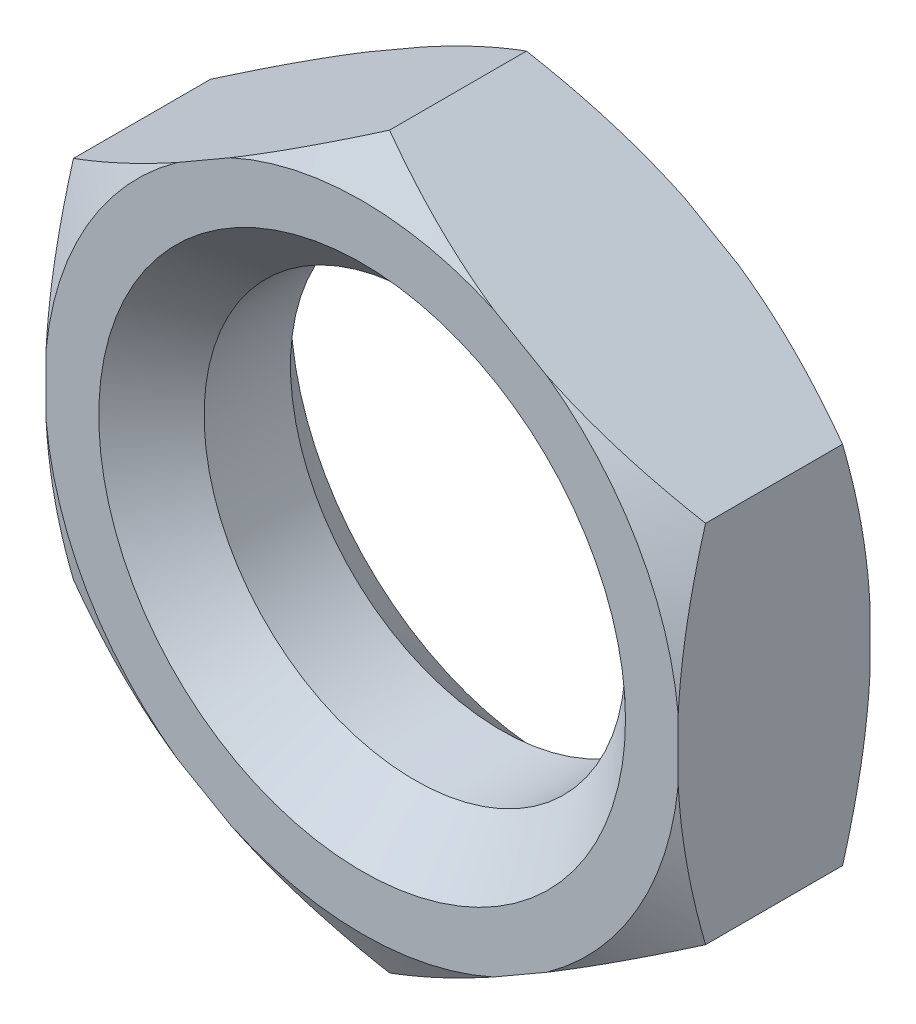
ISO-10303-21;
HEADER;
FILE_DESCRIPTION(('STEP AP214'),'2;1');
FILE_NAME('part.step','',(''),(''),'','','');
FILE_SCHEMA(('AUTOMOTIVE_DESIGN { 1 0 10303 214 1 1 1 1 }'));
ENDSEC;
DATA;
#1=APPLICATION_CONTEXT('core data for automotive mechanical design processes');
#2=APPLICATION_PROTOCOL_DEFINITION('international standard','automotive_design',2000,#1);
#3=PRODUCT_CONTEXT('',#1,'mechanical');
#4=PRODUCT('Part','Part','',(#3));
#5=PRODUCT_RELATED_PRODUCT_CATEGORY('part','',(#4));
#6=PRODUCT_DEFINITION_FORMATION('','',#4);
#7=PRODUCT_DEFINITION_CONTEXT('part definition',#1,'design');
#8=PRODUCT_DEFINITION('design','',#6,#7);
#9=PRODUCT_DEFINITION_SHAPE('','',#8);
#10=(LENGTH_UNIT() NAMED_UNIT(*) SI_UNIT(.MILLI.,.METRE.));
#11=(NAMED_UNIT(*) PLANE_ANGLE_UNIT() SI_UNIT($,.RADIAN.));
#12=(NAMED_UNIT(*) SI_UNIT($,.STERADIAN.) SOLID_ANGLE_UNIT());
#13=UNCERTAINTY_MEASURE_WITH_UNIT(LENGTH_MEASURE(1.E-05),#10,'distance_accuracy_value','');
#14=(GEOMETRIC_REPRESENTATION_CONTEXT(3) GLOBAL_UNCERTAINTY_ASSIGNED_CONTEXT((#13)) GLOBAL_UNIT_ASSIGNED_CONTEXT((#10,
#11,#12)) REPRESENTATION_CONTEXT('',''));
#15=CARTESIAN_POINT('',(0.,0.,0.));
#16=DIRECTION('',(0.,0.,1.));
#17=DIRECTION('',(1.,0.,0.));
#18=AXIS2_PLACEMENT_3D('',#15,#16,#17);
#19=CARTESIAN_POINT('',(15.,8.66025403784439,4.55));
#20=DIRECTION('',(-0.5,-0.866025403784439,0.));
#21=DIRECTION('',(0.866025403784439,-0.5,0.));
#22=AXIS2_PLACEMENT_3D('',#19,#20,#21);
#23=PLANE('',#22);
#24=CARTESIAN_POINT('',(-10.421692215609,23.3374748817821,1.50538592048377));
#25=CARTESIAN_POINT('',(-10.1860353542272,23.2014183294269,1.3781849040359));
#26=CARTESIAN_POINT('',(-9.95009304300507,23.0651969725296,1.25168946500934));
#27=CARTESIAN_POINT('',(-9.47758752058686,22.7923957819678,1.00024785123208));
#28=CARTESIAN_POINT('',(-9.24102430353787,22.6558159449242,0.875301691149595));
#29=CARTESIAN_POINT('',(-8.53027981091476,22.2454674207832,0.502968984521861));
#30=CARTESIAN_POINT('',(-8.05509856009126,21.9711213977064,0.258117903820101));
#31=CARTESIAN_POINT('',(-7.10011910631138,21.4197637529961,-0.224219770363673));
#32=CARTESIAN_POINT('',(-6.62031098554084,21.1427464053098,-0.461680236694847));
#33=CARTESIAN_POINT('',(-5.65710212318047,20.5866375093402,-0.926659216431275));
#34=CARTESIAN_POINT('',(-5.17370149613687,20.3075460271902,-1.15417804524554));
#35=CARTESIAN_POINT('',(-4.19036809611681,19.7398182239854,-1.60273172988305));
#36=CARTESIAN_POINT('',(-3.69032783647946,19.4511198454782,-1.82345385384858));
#37=CARTESIAN_POINT('',(-2.68520502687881,18.8708119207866,-2.24918941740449));
#38=CARTESIAN_POINT('',(-2.1801222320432,18.5792022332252,-2.45420208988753));
#39=CARTESIAN_POINT('',(-1.16479568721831,17.9930031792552,-2.84461906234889));
#40=CARTESIAN_POINT('',(-0.654557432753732,17.6984169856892,-3.03004223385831));
#41=CARTESIAN_POINT('',(0.371909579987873,17.1057859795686,-3.37700298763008));
#42=CARTESIAN_POINT('',(0.88813755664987,16.8077416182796,-3.53854364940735));
#43=CARTESIAN_POINT('',(2.12260575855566,16.0950210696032,-3.88795790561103));
#44=CARTESIAN_POINT('',(2.84372115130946,15.67868490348,-4.0628440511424));
#45=CARTESIAN_POINT('',(3.93277266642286,15.0499207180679,-4.27310783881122));
#46=CARTESIAN_POINT('',(4.29700197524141,14.8396328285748,-4.33451650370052));
#47=CARTESIAN_POINT('',(5.0275063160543,14.4178759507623,-4.43844534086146));
#48=CARTESIAN_POINT('',(5.39378132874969,14.2064069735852,-4.48096569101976));
#49=CARTESIAN_POINT('',(6.1234086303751,13.7851564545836,-4.54551567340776));
#50=CARTESIAN_POINT('',(6.48674542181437,13.5753838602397,-4.56777767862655));
#51=CARTESIAN_POINT('',(7.21392805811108,13.1555447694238,-4.59199131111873));
#52=CARTESIAN_POINT('',(7.57777389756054,12.9454782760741,-4.59394315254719));
#53=CARTESIAN_POINT('',(8.30511523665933,12.5255475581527,-4.57747454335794));
#54=CARTESIAN_POINT('',(8.66861073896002,12.3156833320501,-4.5590542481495));
#55=CARTESIAN_POINT('',(9.3944800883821,11.8966024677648,-4.50239903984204));
#56=CARTESIAN_POINT('',(9.75685375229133,11.6873859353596,-4.46416104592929));
#57=CARTESIAN_POINT('',(10.6125702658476,11.1933377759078,-4.35143576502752));
#58=CARTESIAN_POINT('',(11.1051134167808,10.9089678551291,-4.26879174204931));
#59=CARTESIAN_POINT('',(12.0854941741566,10.3429447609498,-4.07229441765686));
#60=CARTESIAN_POINT('',(12.5733310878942,10.0612919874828,-3.95843659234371));
#61=CARTESIAN_POINT('',(13.5442363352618,9.50073958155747,-3.70380915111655));
#62=CARTESIAN_POINT('',(14.0272986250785,9.22184343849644,-3.56300912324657));
#63=CARTESIAN_POINT('',(14.9880038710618,8.66718000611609,-3.25893381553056));
#64=CARTESIAN_POINT('',(15.4656471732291,8.39141251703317,-3.09565997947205));
#65=CARTESIAN_POINT('',(16.4215113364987,7.83954408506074,-2.74845819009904));
#66=CARTESIAN_POINT('',(16.8996708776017,7.56347854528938,-2.56430671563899));
#67=CARTESIAN_POINT('',(17.8509238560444,7.01427238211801,-2.18051358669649));
#68=CARTESIAN_POINT('',(18.3240204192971,6.7411299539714,-1.98088220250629));
#69=CARTESIAN_POINT('',(19.2658732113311,6.19735099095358,-1.56888560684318));
#70=CARTESIAN_POINT('',(19.7346305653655,5.9267138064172,-1.3565238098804));
#71=CARTESIAN_POINT('',(20.6685220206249,5.38753132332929,-0.921259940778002));
#72=CARTESIAN_POINT('',(21.133655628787,5.11898630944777,-0.698356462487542));
#73=CARTESIAN_POINT('',(21.9203254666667,4.66480226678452,-0.312682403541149));
#74=CARTESIAN_POINT('',(22.2426866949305,4.47868692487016,-0.152146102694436));
#75=CARTESIAN_POINT('',(22.8859893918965,4.10727593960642,0.172641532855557));
#76=CARTESIAN_POINT('',(23.2069309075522,3.92198026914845,0.336892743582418));
#77=CARTESIAN_POINT('',(23.8441453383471,3.55408434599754,0.666912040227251));
#78=CARTESIAN_POINT('',(24.160431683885,3.37147633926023,0.832645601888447));
#79=CARTESIAN_POINT('',(24.7918786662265,3.00691025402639,1.16696568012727));
#80=CARTESIAN_POINT('',(25.1070392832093,2.82495218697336,1.33555224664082));
#81=CARTESIAN_POINT('',(25.421692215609,2.64328723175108,1.50538592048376));
#82=B_SPLINE_CURVE_WITH_KNOTS('',3,(#24,#25,#26,#27,#28,#29,#30,#31,#32,#33,#34,#35,#36,#37,#38,
#39,#40,#41,#42,#43,#44,#45,#46,#47,#48,#49,#50,#51,#52,#53,#54,#55,#56,#57,#58,#59,#60,#61,#62,
#63,#64,#65,#66,#67,#68,#69,#70,#71,#72,#73,#74,#75,#76,#77,#78,#79,#80,#81),.UNSPECIFIED.,.F.,
.F.,(4,2,2,2,2,2,2,2,2,2,2,2,2,2,2,2,2,2,2,2,2,2,2,2,2,2,2,2,4),(0.,0.901125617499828,
1.80225976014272,3.60473793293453,5.41299483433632,7.22119432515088,9.07544754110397,
10.9297912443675,12.7823319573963,14.6346335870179,17.1843859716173,18.4591402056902,
19.7338824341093,20.9938113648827,22.2537270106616,23.5136330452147,24.77373500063,
26.4968317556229,28.2201783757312,29.9454818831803,31.6706746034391,33.416485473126,
35.1611478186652,36.9053442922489,38.6497740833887,39.8658744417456,41.0819342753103,
42.2851062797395,43.488299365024),.UNSPECIFIED.);
#83=CARTESIAN_POINT('',(0.,17.3205080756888,-3.25096189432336));
#84=VERTEX_POINT('',#83);
#85=CARTESIAN_POINT('',(6.23898443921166,13.71842873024,-4.55));
#86=VERTEX_POINT('',#85);
#87=EDGE_CURVE('E177',#84,#86,#82,.T.);
#88=ORIENTED_EDGE('',*,*,#87,.F.);
#89=DIRECTION('',(0.,0.,-1.));
#90=VECTOR('',#89,1.);
#91=CARTESIAN_POINT('',(0.,17.3205080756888,4.55));
#92=LINE('',#91,#90);
#93=CARTESIAN_POINT('',(0.,17.3205080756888,3.25096189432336));
#94=VERTEX_POINT('',#93);
#95=EDGE_CURVE('E223',#94,#84,#92,.T.);
#96=ORIENTED_EDGE('',*,*,#95,.F.);
#97=CARTESIAN_POINT('',(25.421692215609,2.64328723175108,-1.50538592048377));
#98=CARTESIAN_POINT('',(25.1860353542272,2.77934378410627,-1.3781849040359));
#99=CARTESIAN_POINT('',(24.9500930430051,2.9155651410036,-1.25168946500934));
#100=CARTESIAN_POINT('',(24.4775875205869,3.18836633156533,-1.00024785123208));
#101=CARTESIAN_POINT('',(24.2410243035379,3.32494616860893,-0.87530169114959));
#102=CARTESIAN_POINT('',(23.5302798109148,3.73529469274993,-0.502968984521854));
#103=CARTESIAN_POINT('',(23.0550985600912,4.00964071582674,-0.258117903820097));
#104=CARTESIAN_POINT('',(22.1001191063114,4.56099836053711,0.224219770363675));
#105=CARTESIAN_POINT('',(21.6203109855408,4.83801570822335,0.46168023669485));
#106=CARTESIAN_POINT('',(20.6571021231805,5.39412460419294,0.926659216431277));
#107=CARTESIAN_POINT('',(20.1737014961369,5.673216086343,1.15417804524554));
#108=CARTESIAN_POINT('',(19.1903680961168,6.24094388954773,1.60273172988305));
#109=CARTESIAN_POINT('',(18.6903278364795,6.529642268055,1.82345385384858));
#110=CARTESIAN_POINT('',(17.6852050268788,7.10995019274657,2.24918941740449));
#111=CARTESIAN_POINT('',(17.1801222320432,7.40155988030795,2.45420208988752));
#112=CARTESIAN_POINT('',(16.1647956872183,7.98775893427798,2.84461906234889));
#113=CARTESIAN_POINT('',(15.6545574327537,8.28234512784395,3.03004223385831));
#114=CARTESIAN_POINT('',(14.6280904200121,8.87497613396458,3.37700298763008));
#115=CARTESIAN_POINT('',(14.1118624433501,9.1730204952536,3.53854364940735));
#116=CARTESIAN_POINT('',(12.8773942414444,9.88574104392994,3.88795790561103));
#117=CARTESIAN_POINT('',(12.1562788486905,10.3020772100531,4.0628440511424));
#118=CARTESIAN_POINT('',(11.0672273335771,10.9308413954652,4.27310783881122));
#119=CARTESIAN_POINT('',(10.7029980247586,11.1411292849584,4.33451650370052));
#120=CARTESIAN_POINT('',(9.97249368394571,11.5628861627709,4.43844534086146));
#121=CARTESIAN_POINT('',(9.60621867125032,11.774355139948,4.48096569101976));
#122=CARTESIAN_POINT('',(8.8765913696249,12.1956056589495,4.54551567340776));
#123=CARTESIAN_POINT('',(8.51325457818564,12.4053782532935,4.56777767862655));
#124=CARTESIAN_POINT('',(7.78607194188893,12.8252173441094,4.59199131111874));
#125=CARTESIAN_POINT('',(7.42222610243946,13.0352838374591,4.59394315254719));
#126=CARTESIAN_POINT('',(6.69488476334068,13.4552145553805,4.57747454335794));
#127=CARTESIAN_POINT('',(6.33138926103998,13.665078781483,4.5590542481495));
#128=CARTESIAN_POINT('',(5.6055199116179,14.0841596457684,4.50239903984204));
#129=CARTESIAN_POINT('',(5.24314624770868,14.2933761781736,4.46416104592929));
#130=CARTESIAN_POINT('',(4.38742973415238,14.7874243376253,4.35143576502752));
#131=CARTESIAN_POINT('',(3.89488658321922,15.0717942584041,4.26879174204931));
#132=CARTESIAN_POINT('',(2.91450582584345,15.6378173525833,4.07229441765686));
#133=CARTESIAN_POINT('',(2.42666891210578,15.9194701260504,3.95843659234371));
#134=CARTESIAN_POINT('',(1.45576366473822,16.4800225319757,3.70380915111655));
#135=CARTESIAN_POINT('',(0.972701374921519,16.7589186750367,3.56300912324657));
#136=CARTESIAN_POINT('',(0.0119961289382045,17.3135821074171,3.25893381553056));
#137=CARTESIAN_POINT('',(-0.465647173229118,17.5893495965,3.09565997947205));
#138=CARTESIAN_POINT('',(-1.42151133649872,18.1412180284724,2.74845819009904));
#139=CARTESIAN_POINT('',(-1.89967087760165,18.4172835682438,2.56430671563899));
#140=CARTESIAN_POINT('',(-2.85092385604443,18.9664897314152,2.1805135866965));
#141=CARTESIAN_POINT('',(-3.32402041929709,19.2396321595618,1.98088220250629));
#142=CARTESIAN_POINT('',(-4.26587321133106,19.7834111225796,1.56888560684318));
#143=CARTESIAN_POINT('',(-4.73463056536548,20.054048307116,1.3565238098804));
#144=CARTESIAN_POINT('',(-5.66852202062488,20.5932307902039,0.921259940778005));
#145=CARTESIAN_POINT('',(-6.13365562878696,20.8617758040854,0.698356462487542));
#146=CARTESIAN_POINT('',(-6.92032546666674,21.3159598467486,0.31268240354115));
#147=CARTESIAN_POINT('',(-7.24268669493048,21.502075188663,0.152146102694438));
#148=CARTESIAN_POINT('',(-7.88598939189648,21.8734861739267,-0.172641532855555));
#149=CARTESIAN_POINT('',(-8.20693090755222,22.0587818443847,-0.336892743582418));
#150=CARTESIAN_POINT('',(-8.84414533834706,22.4266777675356,-0.666912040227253));
#151=CARTESIAN_POINT('',(-9.16043168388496,22.6092857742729,-0.832645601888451));
#152=CARTESIAN_POINT('',(-9.79187866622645,22.9738518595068,-1.16696568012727));
#153=CARTESIAN_POINT('',(-10.1070392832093,23.1558099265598,-1.33555224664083));
#154=CARTESIAN_POINT('',(-10.421692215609,23.3374748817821,-1.50538592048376));
#155=B_SPLINE_CURVE_WITH_KNOTS('',3,(#97,#98,#99,#100,#101,#102,#103,#104,#105,#106,#107,#108,
#109,#110,#111,#112,#113,#114,#115,#116,#117,#118,#119,#120,#121,#122,#123,#124,#125,#126,#127,
#128,#129,#130,#131,#132,#133,#134,#135,#136,#137,#138,#139,#140,#141,#142,#143,#144,#145,#146,
#147,#148,#149,#150,#151,#152,#153,#154),.UNSPECIFIED.,.F.,.F.,(4,2,2,2,2,2,2,2,2,2,2,2,2,2,2,2,
2,2,2,2,2,2,2,2,2,2,2,2,4),(0.,0.901125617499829,1.80225976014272,3.60473793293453,
5.41299483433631,7.22119432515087,9.07544754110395,10.9297912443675,12.7823319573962,
14.6346335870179,17.1843859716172,18.4591402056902,19.7338824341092,20.9938113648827,
22.2537270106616,23.5136330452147,24.77373500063,26.4968317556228,28.2201783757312,
29.9454818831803,31.6706746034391,33.416485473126,35.1611478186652,36.9053442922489,
38.6497740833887,39.8658744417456,41.0819342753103,42.2851062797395,43.488299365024),.UNSPECIFIED.);
#156=CARTESIAN_POINT('',(6.23898443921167,13.71842873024,4.55));
#157=VERTEX_POINT('',#156);
#158=EDGE_CURVE('E373',#157,#94,#155,.T.);
#159=ORIENTED_EDGE('',*,*,#158,.F.);
#160=DIRECTION('',(-0.866025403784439,0.5,0.));
#161=VECTOR('',#160,1.);
#162=CARTESIAN_POINT('',(15.,8.66025403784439,4.55));
#163=LINE('',#162,#161);
#164=CARTESIAN_POINT('',(8.76101556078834,12.2623333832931,4.55));
#165=VERTEX_POINT('',#164);
#166=EDGE_CURVE('E352',#165,#157,#163,.T.);
#167=ORIENTED_EDGE('',*,*,#166,.F.);
#168=CARTESIAN_POINT('',(15.,8.6602540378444,3.25096189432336));
#169=VERTEX_POINT('',#168);
#170=EDGE_CURVE('E194',#169,#165,#155,.T.);
#171=ORIENTED_EDGE('',*,*,#170,.F.);
#172=DIRECTION('',(0.,0.,-1.));
#173=VECTOR('',#172,1.);
#174=CARTESIAN_POINT('',(15.,8.66025403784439,4.55));
#175=LINE('',#174,#173);
#176=CARTESIAN_POINT('',(15.,8.6602540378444,-3.25096189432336));
#177=VERTEX_POINT('',#176);
#178=EDGE_CURVE('E183',#169,#177,#175,.T.);
#179=ORIENTED_EDGE('',*,*,#178,.T.);
#180=CARTESIAN_POINT('',(8.76101556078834,12.2623333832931,-4.55));
#181=VERTEX_POINT('',#180);
#182=EDGE_CURVE('E164',#181,#177,#82,.T.);
#183=ORIENTED_EDGE('',*,*,#182,.F.);
#184=DIRECTION('',(-0.866025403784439,0.5,0.));
#185=VECTOR('',#184,1.);
#186=CARTESIAN_POINT('',(15.,8.66025403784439,-4.55));
#187=LINE('',#186,#185);
#188=EDGE_CURVE('E264',#181,#86,#187,.T.);
#189=ORIENTED_EDGE('',*,*,#188,.T.);
#190=EDGE_LOOP('',(#88,#96,#159,#167,#171,#179,#183,#189));
#191=FACE_BOUND('',#190,.T.);
#192=ADVANCED_FACE('F39',(#191),#23,.F.);
#193=CARTESIAN_POINT('',(0.,17.3205080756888,4.55));
#194=DIRECTION('',(0.5,-0.866025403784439,0.));
#195=DIRECTION('',(0.866025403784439,0.5,0.));
#196=AXIS2_PLACEMENT_3D('',#193,#194,#195);
#197=PLANE('',#196);
#198=CARTESIAN_POINT('',(-25.421692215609,2.64328723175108,1.50538592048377));
#199=CARTESIAN_POINT('',(-25.1860353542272,2.77934378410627,1.3781849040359));
#200=CARTESIAN_POINT('',(-24.9500930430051,2.9155651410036,1.25168946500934));
#201=CARTESIAN_POINT('',(-24.4775875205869,3.18836633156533,1.00024785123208));
#202=CARTESIAN_POINT('',(-24.2410243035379,3.32494616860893,0.875301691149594));
#203=CARTESIAN_POINT('',(-23.5302798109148,3.73529469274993,0.502968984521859));
#204=CARTESIAN_POINT('',(-23.0550985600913,4.00964071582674,0.258117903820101));
#205=CARTESIAN_POINT('',(-22.1001191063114,4.56099836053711,-0.224219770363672));
#206=CARTESIAN_POINT('',(-21.6203109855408,4.83801570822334,-0.461680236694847));
#207=CARTESIAN_POINT('',(-20.6571021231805,5.39412460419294,-0.926659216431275));
#208=CARTESIAN_POINT('',(-20.1737014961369,5.67321608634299,-1.15417804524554));
#209=CARTESIAN_POINT('',(-19.1903680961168,6.24094388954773,-1.60273172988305));
#210=CARTESIAN_POINT('',(-18.6903278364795,6.529642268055,-1.82345385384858));
#211=CARTESIAN_POINT('',(-17.6852050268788,7.10995019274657,-2.24918941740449));
#212=CARTESIAN_POINT('',(-17.1801222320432,7.40155988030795,-2.45420208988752));
#213=CARTESIAN_POINT('',(-16.1647956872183,7.98775893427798,-2.84461906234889));
#214=CARTESIAN_POINT('',(-15.6545574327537,8.28234512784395,-3.03004223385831));
#215=CARTESIAN_POINT('',(-14.6280904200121,8.87497613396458,-3.37700298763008));
#216=CARTESIAN_POINT('',(-14.1118624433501,9.1730204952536,-3.53854364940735));
#217=CARTESIAN_POINT('',(-12.8773942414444,9.88574104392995,-3.88795790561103));
#218=CARTESIAN_POINT('',(-12.1562788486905,10.3020772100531,-4.0628440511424));
#219=CARTESIAN_POINT('',(-11.0672273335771,10.9308413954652,-4.27310783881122));
#220=CARTESIAN_POINT('',(-10.7029980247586,11.1411292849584,-4.33451650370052));
#221=CARTESIAN_POINT('',(-9.97249368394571,11.5628861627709,-4.43844534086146));
#222=CARTESIAN_POINT('',(-9.60621867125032,11.774355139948,-4.48096569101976));
#223=CARTESIAN_POINT('',(-8.8765913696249,12.1956056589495,-4.54551567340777));
#224=CARTESIAN_POINT('',(-8.51325457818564,12.4053782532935,-4.56777767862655));
#225=CARTESIAN_POINT('',(-7.78607194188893,12.8252173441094,-4.59199131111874));
#226=CARTESIAN_POINT('',(-7.42222610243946,13.0352838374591,-4.59394315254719));
#227=CARTESIAN_POINT('',(-6.69488476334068,13.4552145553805,-4.57747454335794));
#228=CARTESIAN_POINT('',(-6.33138926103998,13.665078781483,-4.5590542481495));
#229=CARTESIAN_POINT('',(-5.6055199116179,14.0841596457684,-4.50239903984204));
#230=CARTESIAN_POINT('',(-5.24314624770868,14.2933761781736,-4.46416104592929));
#231=CARTESIAN_POINT('',(-4.38742973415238,14.7874243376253,-4.35143576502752));
#232=CARTESIAN_POINT('',(-3.89488658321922,15.0717942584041,-4.26879174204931));
#233=CARTESIAN_POINT('',(-2.91450582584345,15.6378173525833,-4.07229441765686));
#234=CARTESIAN_POINT('',(-2.42666891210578,15.9194701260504,-3.95843659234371));
#235=CARTESIAN_POINT('',(-1.45576366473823,16.4800225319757,-3.70380915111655));
#236=CARTESIAN_POINT('',(-0.972701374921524,16.7589186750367,-3.56300912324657));
#237=CARTESIAN_POINT('',(-0.0119961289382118,17.3135821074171,-3.25893381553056));
#238=CARTESIAN_POINT('',(0.46564717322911,17.5893495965,-3.09565997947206));
#239=CARTESIAN_POINT('',(1.42151133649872,18.1412180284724,-2.74845819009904));
#240=CARTESIAN_POINT('',(1.89967087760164,18.4172835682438,-2.56430671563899));
#241=CARTESIAN_POINT('',(2.85092385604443,18.9664897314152,-2.1805135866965));
#242=CARTESIAN_POINT('',(3.32402041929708,19.2396321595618,-1.98088220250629));
#243=CARTESIAN_POINT('',(4.26587321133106,19.7834111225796,-1.56888560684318));
#244=CARTESIAN_POINT('',(4.73463056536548,20.054048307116,-1.3565238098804));
#245=CARTESIAN_POINT('',(5.66852202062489,20.5932307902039,-0.921259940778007));
#246=CARTESIAN_POINT('',(6.13365562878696,20.8617758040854,-0.698356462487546));
#247=CARTESIAN_POINT('',(6.92032546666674,21.3159598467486,-0.312682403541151));
#248=CARTESIAN_POINT('',(7.24268669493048,21.502075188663,-0.152146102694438));
#249=CARTESIAN_POINT('',(7.88598939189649,21.8734861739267,0.172641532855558));
#250=CARTESIAN_POINT('',(8.20693090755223,22.0587818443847,0.33689274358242));
#251=CARTESIAN_POINT('',(8.84414533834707,22.4266777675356,0.666912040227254));
#252=CARTESIAN_POINT('',(9.16043168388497,22.6092857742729,0.832645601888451));
#253=CARTESIAN_POINT('',(9.79187866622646,22.9738518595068,1.16696568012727));
#254=CARTESIAN_POINT('',(10.1070392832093,23.1558099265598,1.33555224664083));
#255=CARTESIAN_POINT('',(10.4216922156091,23.3374748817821,1.50538592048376));
#256=B_SPLINE_CURVE_WITH_KNOTS('',3,(#198,#199,#200,#201,#202,#203,#204,#205,#206,#207,#208,
#209,#210,#211,#212,#213,#214,#215,#216,#217,#218,#219,#220,#221,#222,#223,#224,#225,#226,#227,
#228,#229,#230,#231,#232,#233,#234,#235,#236,#237,#238,#239,#240,#241,#242,#243,#244,#245,#246,
#247,#248,#249,#250,#251,#252,#253,#254,#255),.UNSPECIFIED.,.F.,.F.,(4,2,2,2,2,2,2,2,2,2,2,2,2,
2,2,2,2,2,2,2,2,2,2,2,2,2,2,2,4),(0.,0.901125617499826,1.80225976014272,3.60473793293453,
5.41299483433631,7.22119432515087,9.07544754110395,10.9297912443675,12.7823319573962,
14.6346335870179,17.1843859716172,18.4591402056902,19.7338824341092,20.9938113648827,
22.2537270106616,23.5136330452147,24.77373500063,26.4968317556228,28.2201783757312,
29.9454818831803,31.6706746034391,33.416485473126,35.1611478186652,36.9053442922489,
38.6497740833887,39.8658744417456,41.0819342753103,42.2851062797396,43.488299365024),.UNSPECIFIED.);
#257=CARTESIAN_POINT('',(-15.,8.6602540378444,-3.25096189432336));
#258=VERTEX_POINT('',#257);
#259=CARTESIAN_POINT('',(-8.76101556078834,12.2623333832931,-4.55));
#260=VERTEX_POINT('',#259);
#261=EDGE_CURVE('E55',#258,#260,#256,.T.);
#262=ORIENTED_EDGE('',*,*,#261,.F.);
#263=DIRECTION('',(0.,0.,-1.));
#264=VECTOR('',#263,1.);
#265=CARTESIAN_POINT('',(-15.,8.66025403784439,4.55));
#266=LINE('',#265,#264);
#267=CARTESIAN_POINT('',(-15.,8.6602540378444,3.25096189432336));
#268=VERTEX_POINT('',#267);
#269=EDGE_CURVE('E219',#268,#258,#266,.T.);
#270=ORIENTED_EDGE('',*,*,#269,.F.);
#271=CARTESIAN_POINT('',(10.421692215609,23.3374748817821,-1.50538592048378));
#272=CARTESIAN_POINT('',(10.1860353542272,23.2014183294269,-1.3781849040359));
#273=CARTESIAN_POINT('',(9.95009304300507,23.0651969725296,-1.25168946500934));
#274=CARTESIAN_POINT('',(9.47758752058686,22.7923957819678,-1.00024785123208));
#275=CARTESIAN_POINT('',(9.24102430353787,22.6558159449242,-0.875301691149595));
#276=CARTESIAN_POINT('',(8.53027981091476,22.2454674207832,-0.50296898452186));
#277=CARTESIAN_POINT('',(8.05509856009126,21.9711213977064,-0.258117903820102));
#278=CARTESIAN_POINT('',(7.10011910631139,21.4197637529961,0.224219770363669));
#279=CARTESIAN_POINT('',(6.62031098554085,21.1427464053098,0.461680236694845));
#280=CARTESIAN_POINT('',(5.65710212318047,20.5866375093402,0.926659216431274));
#281=CARTESIAN_POINT('',(5.17370149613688,20.3075460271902,1.15417804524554));
#282=CARTESIAN_POINT('',(4.19036809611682,19.7398182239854,1.60273172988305));
#283=CARTESIAN_POINT('',(3.69032783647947,19.4511198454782,1.82345385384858));
#284=CARTESIAN_POINT('',(2.68520502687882,18.8708119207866,2.24918941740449));
#285=CARTESIAN_POINT('',(2.18012223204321,18.5792022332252,2.45420208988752));
#286=CARTESIAN_POINT('',(1.16479568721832,17.9930031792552,2.84461906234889));
#287=CARTESIAN_POINT('',(0.654557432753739,17.6984169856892,3.03004223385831));
#288=CARTESIAN_POINT('',(-0.371909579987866,17.1057859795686,3.37700298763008));
#289=CARTESIAN_POINT('',(-0.888137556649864,16.8077416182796,3.53854364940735));
#290=CARTESIAN_POINT('',(-2.12260575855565,16.0950210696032,3.88795790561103));
#291=CARTESIAN_POINT('',(-2.84372115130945,15.67868490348,4.0628440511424));
#292=CARTESIAN_POINT('',(-3.93277266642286,15.0499207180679,4.27310783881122));
#293=CARTESIAN_POINT('',(-4.2970019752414,14.8396328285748,4.33451650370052));
#294=CARTESIAN_POINT('',(-5.02750631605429,14.4178759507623,4.43844534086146));
#295=CARTESIAN_POINT('',(-5.39378132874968,14.2064069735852,4.48096569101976));
#296=CARTESIAN_POINT('',(-6.1234086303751,13.7851564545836,4.54551567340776));
#297=CARTESIAN_POINT('',(-6.48674542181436,13.5753838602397,4.56777767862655));
#298=CARTESIAN_POINT('',(-7.21392805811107,13.1555447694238,4.59199131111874));
#299=CARTESIAN_POINT('',(-7.57777389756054,12.9454782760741,4.59394315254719));
#300=CARTESIAN_POINT('',(-8.30511523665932,12.5255475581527,4.57747454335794));
#301=CARTESIAN_POINT('',(-8.66861073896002,12.3156833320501,4.5590542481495));
#302=CARTESIAN_POINT('',(-9.3944800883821,11.8966024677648,4.50239903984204));
#303=CARTESIAN_POINT('',(-9.75685375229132,11.6873859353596,4.46416104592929));
#304=CARTESIAN_POINT('',(-10.6125702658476,11.1933377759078,4.35143576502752));
#305=CARTESIAN_POINT('',(-11.1051134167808,10.9089678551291,4.26879174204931));
#306=CARTESIAN_POINT('',(-12.0854941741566,10.3429447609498,4.07229441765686));
#307=CARTESIAN_POINT('',(-12.5733310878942,10.0612919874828,3.95843659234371));
#308=CARTESIAN_POINT('',(-13.5442363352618,9.50073958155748,3.70380915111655));
#309=CARTESIAN_POINT('',(-14.0272986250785,9.22184343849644,3.56300912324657));
#310=CARTESIAN_POINT('',(-14.9880038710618,8.66718000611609,3.25893381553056));
#311=CARTESIAN_POINT('',(-15.4656471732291,8.39141251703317,3.09565997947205));
#312=CARTESIAN_POINT('',(-16.4215113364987,7.83954408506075,2.74845819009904));
#313=CARTESIAN_POINT('',(-16.8996708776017,7.56347854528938,2.56430671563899));
#314=CARTESIAN_POINT('',(-17.8509238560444,7.01427238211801,2.18051358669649));
#315=CARTESIAN_POINT('',(-18.3240204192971,6.7411299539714,1.98088220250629));
#316=CARTESIAN_POINT('',(-19.2658732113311,6.19735099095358,1.56888560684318));
#317=CARTESIAN_POINT('',(-19.7346305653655,5.9267138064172,1.3565238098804));
#318=CARTESIAN_POINT('',(-20.6685220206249,5.38753132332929,0.921259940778));
#319=CARTESIAN_POINT('',(-21.133655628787,5.11898630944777,0.698356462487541));
#320=CARTESIAN_POINT('',(-21.9203254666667,4.66480226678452,0.312682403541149));
#321=CARTESIAN_POINT('',(-22.2426866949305,4.47868692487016,0.152146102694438));
#322=CARTESIAN_POINT('',(-22.8859893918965,4.10727593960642,-0.172641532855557));
#323=CARTESIAN_POINT('',(-23.2069309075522,3.92198026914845,-0.33689274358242));
#324=CARTESIAN_POINT('',(-23.8441453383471,3.55408434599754,-0.666912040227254));
#325=CARTESIAN_POINT('',(-24.160431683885,3.37147633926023,-0.832645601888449));
#326=CARTESIAN_POINT('',(-24.7918786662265,3.0069102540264,-1.16696568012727));
#327=CARTESIAN_POINT('',(-25.1070392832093,2.82495218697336,-1.33555224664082));
#328=CARTESIAN_POINT('',(-25.421692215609,2.64328723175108,-1.50538592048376));
#329=B_SPLINE_CURVE_WITH_KNOTS('',3,(#271,#272,#273,#274,#275,#276,#277,#278,#279,#280,#281,
#282,#283,#284,#285,#286,#287,#288,#289,#290,#291,#292,#293,#294,#295,#296,#297,#298,#299,#300,
#301,#302,#303,#304,#305,#306,#307,#308,#309,#310,#311,#312,#313,#314,#315,#316,#317,#318,#319,
#320,#321,#322,#323,#324,#325,#326,#327,#328),.UNSPECIFIED.,.F.,.F.,(4,2,2,2,2,2,2,2,2,2,2,2,2,
2,2,2,2,2,2,2,2,2,2,2,2,2,2,2,4),(0.,0.901125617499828,1.80225976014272,3.60473793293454,
5.41299483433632,7.22119432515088,9.07544754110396,10.9297912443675,12.7823319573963,
14.6346335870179,17.1843859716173,18.4591402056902,19.7338824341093,20.9938113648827,
22.2537270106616,23.5136330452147,24.77373500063,26.4968317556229,28.2201783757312,
29.9454818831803,31.6706746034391,33.416485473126,35.1611478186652,36.9053442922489,
38.6497740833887,39.8658744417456,41.0819342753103,42.2851062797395,43.488299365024),.UNSPECIFIED.);
#330=CARTESIAN_POINT('',(-8.76101556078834,12.2623333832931,4.55));
#331=VERTEX_POINT('',#330);
#332=EDGE_CURVE('E345',#331,#268,#329,.T.);
#333=ORIENTED_EDGE('',*,*,#332,.F.);
#334=DIRECTION('',(-0.866025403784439,-0.5,0.));
#335=VECTOR('',#334,1.);
#336=CARTESIAN_POINT('',(0.,17.3205080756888,4.55));
#337=LINE('',#336,#335);
#338=CARTESIAN_POINT('',(-6.23898443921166,13.71842873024,4.55));
#339=VERTEX_POINT('',#338);
#340=EDGE_CURVE('E356',#339,#331,#337,.T.);
#341=ORIENTED_EDGE('',*,*,#340,.F.);
#342=EDGE_CURVE('E351',#94,#339,#329,.T.);
#343=ORIENTED_EDGE('',*,*,#342,.F.);
#344=ORIENTED_EDGE('',*,*,#95,.T.);
#345=CARTESIAN_POINT('',(-6.23898443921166,13.71842873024,-4.55));
#346=VERTEX_POINT('',#345);
#347=EDGE_CURVE('E425',#346,#84,#256,.T.);
#348=ORIENTED_EDGE('',*,*,#347,.F.);
#349=DIRECTION('',(-0.866025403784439,-0.5,0.));
#350=VECTOR('',#349,1.);
#351=CARTESIAN_POINT('',(0.,17.3205080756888,-4.55));
#352=LINE('',#351,#350);
#353=EDGE_CURVE('E372',#346,#260,#352,.T.);
#354=ORIENTED_EDGE('',*,*,#353,.T.);
#355=EDGE_LOOP('',(#262,#270,#333,#341,#343,#344,#348,#354));
#356=FACE_BOUND('',#355,.T.);
#357=ADVANCED_FACE('F325',(#356),#197,.F.);
#358=CARTESIAN_POINT('',(-15.,8.66025403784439,4.55));
#359=DIRECTION('',(1.,0.,0.));
#360=DIRECTION('',(0.,1.,0.));
#361=AXIS2_PLACEMENT_3D('',#358,#359,#360);
#362=PLANE('',#361);
#363=CARTESIAN_POINT('',(-15.,-19.0819462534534,0.762373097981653));
#364=CARTESIAN_POINT('',(-15.,-18.8109804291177,0.639384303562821));
#365=CARTESIAN_POINT('',(-15.,-18.5396403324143,0.517220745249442));
#366=CARTESIAN_POINT('',(-15.,-17.9961450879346,0.274710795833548));
#367=CARTESIAN_POINT('',(-15.,-17.7239899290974,0.154364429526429));
#368=CARTESIAN_POINT('',(-15.,-16.9061217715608,-0.203733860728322));
#369=CARTESIAN_POINT('',(-15.,-16.359096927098,-0.438503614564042));
#370=CARTESIAN_POINT('',(-15.,-15.258717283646,-0.899383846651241));
#371=CARTESIAN_POINT('',(-15.,-14.7053455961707,-1.12545410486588));
#372=CARTESIAN_POINT('',(-15.,-13.5939263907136,-1.5657662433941));
#373=CARTESIAN_POINT('',(-15.,-13.0358790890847,-1.780008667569));
#374=CARTESIAN_POINT('',(-15.,-11.9169150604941,-2.1931044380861));
#375=CARTESIAN_POINT('',(-15.,-11.3560221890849,-2.39202208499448));
#376=CARTESIAN_POINT('',(-15.,-10.2282423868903,-2.77229423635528));
#377=CARTESIAN_POINT('',(-15.,-9.66135516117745,-2.95364787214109));
#378=CARTESIAN_POINT('',(-15.,-8.52185364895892,-3.29464182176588));
#379=CARTESIAN_POINT('',(-15.,-7.94924789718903,-3.45431044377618));
#380=CARTESIAN_POINT('',(-15.,-6.79740958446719,-3.74766596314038));
#381=CARTESIAN_POINT('',(-15.,-6.21817796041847,-3.88135648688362));
#382=CARTESIAN_POINT('',(-15.,-5.21830810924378,-4.08439201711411));
#383=CARTESIAN_POINT('',(-15.,-4.79919250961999,-4.16123869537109));
#384=CARTESIAN_POINT('',(-15.,-3.95809524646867,-4.29731060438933));
#385=CARTESIAN_POINT('',(-15.,-3.53611367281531,-4.35653638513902));
#386=CARTESIAN_POINT('',(-15.,-2.68998995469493,-4.4558013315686));
#387=CARTESIAN_POINT('',(-15.,-2.26584838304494,-4.49584534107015));
#388=CARTESIAN_POINT('',(-15.,-1.41612275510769,-4.55560652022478));
#389=CARTESIAN_POINT('',(-15.,-0.990538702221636,-4.5753237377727));
#390=CARTESIAN_POINT('',(-15.,-0.139131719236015,-4.59381651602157));
#391=CARTESIAN_POINT('',(-15.,0.286690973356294,-4.59260290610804));
#392=CARTESIAN_POINT('',(-15.,1.13775651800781,-4.569299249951));
#393=CARTESIAN_POINT('',(-15.,1.56299937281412,-4.54720930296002));
#394=CARTESIAN_POINT('',(-15.,2.41198472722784,-4.48282755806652));
#395=CARTESIAN_POINT('',(-15.,2.83572706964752,-4.44053370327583));
#396=CARTESIAN_POINT('',(-15.,3.6808734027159,-4.33696172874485));
#397=CARTESIAN_POINT('',(-15.,4.1022772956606,-4.2756828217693));
#398=CARTESIAN_POINT('',(-15.,5.15251159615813,-4.1006543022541));
#399=CARTESIAN_POINT('',(-15.,5.77953250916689,-3.97599616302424));
#400=CARTESIAN_POINT('',(-15.,7.02605024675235,-3.69348266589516));
#401=CARTESIAN_POINT('',(-15.,7.64554536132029,-3.53561990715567));
#402=CARTESIAN_POINT('',(-15.,8.87824229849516,-3.19228425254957));
#403=CARTESIAN_POINT('',(-15.,9.49142713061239,-3.00675094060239));
#404=CARTESIAN_POINT('',(-15.,10.7105635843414,-2.61359860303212));
#405=CARTESIAN_POINT('',(-15.,11.3165157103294,-2.40598112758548));
#406=CARTESIAN_POINT('',(-15.,12.5289307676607,-1.97050263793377));
#407=CARTESIAN_POINT('',(-15.,13.1353195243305,-1.74243638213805));
#408=CARTESIAN_POINT('',(-15.,14.3424224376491,-1.2717153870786));
#409=CARTESIAN_POINT('',(-15.,14.9431362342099,-1.02905972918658));
#410=CARTESIAN_POINT('',(-15.,16.1359402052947,-0.53354446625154));
#411=CARTESIAN_POINT('',(-15.,16.728060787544,-0.280757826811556));
#412=CARTESIAN_POINT('',(-15.,17.6130673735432,0.105471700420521));
#413=CARTESIAN_POINT('',(-15.,17.9075066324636,0.235374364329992));
#414=CARTESIAN_POINT('',(-15.,18.4954251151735,0.497320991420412));
#415=CARTESIAN_POINT('',(-15.,18.7889043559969,0.629364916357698));
#416=CARTESIAN_POINT('',(-15.,19.0819462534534,0.762373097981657));
#417=B_SPLINE_CURVE_WITH_KNOTS('',3,(#363,#364,#365,#366,#367,#368,#369,#370,#371,#372,#373,
#374,#375,#376,#377,#378,#379,#380,#381,#382,#383,#384,#385,#386,#387,#388,#389,#390,#391,#392,
#393,#394,#395,#396,#397,#398,#399,#400,#401,#402,#403,#404,#405,#406,#407,#408,#409,#410,#411,
#412,#413,#414,#415,#416),.UNSPECIFIED.,.F.,.F.,(4,2,2,2,2,2,2,2,2,2,2,2,2,2,2,2,2,2,2,2,2,2,2,
2,2,2,4),(0.,0.8927115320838,1.78543523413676,3.57118203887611,5.36438019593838,
7.15749583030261,8.94262389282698,10.727840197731,12.5107031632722,14.2933170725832,
15.5712988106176,16.8492406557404,18.1268596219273,19.4044755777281,20.6814305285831,
21.9583794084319,23.2354583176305,24.512590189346,26.4293116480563,28.3464607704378,
30.2678588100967,32.189122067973,34.1324672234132,36.0759348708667,38.0072981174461,
38.9727563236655,39.938197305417),.UNSPECIFIED.);
#418=CARTESIAN_POINT('',(-15.,-8.66025403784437,-3.25096189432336));
#419=VERTEX_POINT('',#418);
#420=CARTESIAN_POINT('',(-15.,-1.45609534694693,-4.55));
#421=VERTEX_POINT('',#420);
#422=EDGE_CURVE('E63',#419,#421,#417,.T.);
#423=ORIENTED_EDGE('',*,*,#422,.F.);
#424=DIRECTION('',(0.,0.,-1.));
#425=VECTOR('',#424,1.);
#426=CARTESIAN_POINT('',(-15.,-8.66025403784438,4.55));
#427=LINE('',#426,#425);
#428=CARTESIAN_POINT('',(-15.,-8.66025403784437,3.25096189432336));
#429=VERTEX_POINT('',#428);
#430=EDGE_CURVE('E215',#429,#419,#427,.T.);
#431=ORIENTED_EDGE('',*,*,#430,.F.);
#432=CARTESIAN_POINT('',(-15.,19.0819462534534,-0.762373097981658));
#433=CARTESIAN_POINT('',(-15.,18.8109804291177,-0.639384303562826));
#434=CARTESIAN_POINT('',(-15.,18.5396403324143,-0.517220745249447));
#435=CARTESIAN_POINT('',(-15.,17.9961450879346,-0.274710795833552));
#436=CARTESIAN_POINT('',(-15.,17.7239899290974,-0.154364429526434));
#437=CARTESIAN_POINT('',(-15.,16.9061217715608,0.203733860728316));
#438=CARTESIAN_POINT('',(-15.,16.359096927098,0.438503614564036));
#439=CARTESIAN_POINT('',(-15.,15.258717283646,0.899383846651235));
#440=CARTESIAN_POINT('',(-15.,14.7053455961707,1.12545410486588));
#441=CARTESIAN_POINT('',(-15.,13.5939263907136,1.5657662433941));
#442=CARTESIAN_POINT('',(-15.,13.0358790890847,1.780008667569));
#443=CARTESIAN_POINT('',(-15.,11.9169150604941,2.1931044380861));
#444=CARTESIAN_POINT('',(-15.,11.3560221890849,2.39202208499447));
#445=CARTESIAN_POINT('',(-15.,10.2282423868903,2.77229423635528));
#446=CARTESIAN_POINT('',(-15.,9.66135516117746,2.95364787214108));
#447=CARTESIAN_POINT('',(-15.,8.52185364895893,3.29464182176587));
#448=CARTESIAN_POINT('',(-15.,7.94924789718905,3.45431044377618));
#449=CARTESIAN_POINT('',(-15.,6.7974095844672,3.74766596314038));
#450=CARTESIAN_POINT('',(-15.,6.21817796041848,3.88135648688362));
#451=CARTESIAN_POINT('',(-15.,5.21830810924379,4.0843920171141));
#452=CARTESIAN_POINT('',(-15.,4.79919250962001,4.16123869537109));
#453=CARTESIAN_POINT('',(-15.,3.95809524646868,4.29731060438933));
#454=CARTESIAN_POINT('',(-15.,3.53611367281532,4.35653638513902));
#455=CARTESIAN_POINT('',(-15.,2.68998995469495,4.4558013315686));
#456=CARTESIAN_POINT('',(-15.,2.26584838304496,4.49584534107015));
#457=CARTESIAN_POINT('',(-15.,1.4161227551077,4.55560652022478));
#458=CARTESIAN_POINT('',(-15.,0.990538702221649,4.5753237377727));
#459=CARTESIAN_POINT('',(-15.,0.139131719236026,4.59381651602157));
#460=CARTESIAN_POINT('',(-15.,-0.286690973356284,4.59260290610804));
#461=CARTESIAN_POINT('',(-15.,-1.1377565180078,4.569299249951));
#462=CARTESIAN_POINT('',(-15.,-1.56299937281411,4.54720930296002));
#463=CARTESIAN_POINT('',(-15.,-2.41198472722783,4.48282755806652));
#464=CARTESIAN_POINT('',(-15.,-2.83572706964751,4.44053370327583));
#465=CARTESIAN_POINT('',(-15.,-3.68087340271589,4.33696172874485));
#466=CARTESIAN_POINT('',(-15.,-4.10227729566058,4.2756828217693));
#467=CARTESIAN_POINT('',(-15.,-5.15251159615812,4.10065430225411));
#468=CARTESIAN_POINT('',(-15.,-5.77953250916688,3.97599616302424));
#469=CARTESIAN_POINT('',(-15.,-7.02605024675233,3.69348266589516));
#470=CARTESIAN_POINT('',(-15.,-7.64554536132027,3.53561990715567));
#471=CARTESIAN_POINT('',(-15.,-8.87824229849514,3.19228425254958));
#472=CARTESIAN_POINT('',(-15.,-9.49142713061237,3.0067509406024));
#473=CARTESIAN_POINT('',(-15.,-10.7105635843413,2.61359860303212));
#474=CARTESIAN_POINT('',(-15.,-11.3165157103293,2.40598112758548));
#475=CARTESIAN_POINT('',(-15.,-12.5289307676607,1.97050263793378));
#476=CARTESIAN_POINT('',(-15.,-13.1353195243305,1.74243638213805));
#477=CARTESIAN_POINT('',(-15.,-14.3424224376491,1.2717153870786));
#478=CARTESIAN_POINT('',(-15.,-14.9431362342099,1.02905972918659));
#479=CARTESIAN_POINT('',(-15.,-16.1359402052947,0.533544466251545));
#480=CARTESIAN_POINT('',(-15.,-16.728060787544,0.280757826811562));
#481=CARTESIAN_POINT('',(-15.,-17.6130673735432,-0.105471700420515));
#482=CARTESIAN_POINT('',(-15.,-17.9075066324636,-0.235374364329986));
#483=CARTESIAN_POINT('',(-15.,-18.4954251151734,-0.497320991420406));
#484=CARTESIAN_POINT('',(-15.,-18.7889043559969,-0.629364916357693));
#485=CARTESIAN_POINT('',(-15.,-19.0819462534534,-0.762373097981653));
#486=B_SPLINE_CURVE_WITH_KNOTS('',3,(#432,#433,#434,#435,#436,#437,#438,#439,#440,#441,#442,
#443,#444,#445,#446,#447,#448,#449,#450,#451,#452,#453,#454,#455,#456,#457,#458,#459,#460,#461,
#462,#463,#464,#465,#466,#467,#468,#469,#470,#471,#472,#473,#474,#475,#476,#477,#478,#479,#480,
#481,#482,#483,#484,#485),.UNSPECIFIED.,.F.,.F.,(4,2,2,2,2,2,2,2,2,2,2,2,2,2,2,2,2,2,2,2,2,2,2,
2,2,2,4),(0.,0.892711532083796,1.78543523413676,3.57118203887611,5.36438019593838,
7.15749583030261,8.94262389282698,10.727840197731,12.5107031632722,14.2933170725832,
15.5712988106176,16.8492406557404,18.1268596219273,19.4044755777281,20.6814305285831,
21.9583794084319,23.2354583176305,24.512590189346,26.4293116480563,28.3464607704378,
30.2678588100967,32.189122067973,34.1324672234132,36.0759348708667,38.0072981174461,
38.9727563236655,39.938197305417),.UNSPECIFIED.);
#487=CARTESIAN_POINT('',(-15.,-1.45609534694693,4.55));
#488=VERTEX_POINT('',#487);
#489=EDGE_CURVE('E331',#488,#429,#486,.T.);
#490=ORIENTED_EDGE('',*,*,#489,.F.);
#491=DIRECTION('',(0.,-1.,0.));
#492=VECTOR('',#491,1.);
#493=CARTESIAN_POINT('',(-15.,8.66025403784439,4.55));
#494=LINE('',#493,#492);
#495=CARTESIAN_POINT('',(-15.,1.45609534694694,4.55));
#496=VERTEX_POINT('',#495);
#497=EDGE_CURVE('E360',#496,#488,#494,.T.);
#498=ORIENTED_EDGE('',*,*,#497,.F.);
#499=EDGE_CURVE('E338',#268,#496,#486,.T.);
#500=ORIENTED_EDGE('',*,*,#499,.F.);
#501=ORIENTED_EDGE('',*,*,#269,.T.);
#502=CARTESIAN_POINT('',(-15.,1.45609534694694,-4.55));
#503=VERTEX_POINT('',#502);
#504=EDGE_CURVE('E314',#503,#258,#417,.T.);
#505=ORIENTED_EDGE('',*,*,#504,.F.);
#506=DIRECTION('',(0.,-1.,0.));
#507=VECTOR('',#506,1.);
#508=CARTESIAN_POINT('',(-15.,8.66025403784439,-4.55));
#509=LINE('',#508,#507);
#510=EDGE_CURVE('E377',#503,#421,#509,.T.);
#511=ORIENTED_EDGE('',*,*,#510,.T.);
#512=EDGE_LOOP('',(#423,#431,#490,#498,#500,#501,#505,#511));
#513=FACE_BOUND('',#512,.T.);
#514=ADVANCED_FACE('F321',(#513),#362,.F.);
#515=CARTESIAN_POINT('',(-15.,-8.66025403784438,4.55));
#516=DIRECTION('',(0.5,0.866025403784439,0.));
#517=DIRECTION('',(-0.866025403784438,0.5,0.));
#518=AXIS2_PLACEMENT_3D('',#515,#516,#517);
#519=PLANE('',#518);
#520=CARTESIAN_POINT('',(10.421692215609,-23.3374748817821,1.50538592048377));
#521=CARTESIAN_POINT('',(10.1860353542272,-23.2014183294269,1.3781849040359));
#522=CARTESIAN_POINT('',(9.95009304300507,-23.0651969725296,1.25168946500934));
#523=CARTESIAN_POINT('',(9.47758752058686,-22.7923957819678,1.00024785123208));
#524=CARTESIAN_POINT('',(9.24102430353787,-22.6558159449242,0.875301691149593));
#525=CARTESIAN_POINT('',(8.53027981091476,-22.2454674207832,0.502968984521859));
#526=CARTESIAN_POINT('',(8.05509856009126,-21.9711213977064,0.258117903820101));
#527=CARTESIAN_POINT('',(7.10011910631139,-21.4197637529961,-0.22421977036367));
#528=CARTESIAN_POINT('',(6.62031098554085,-21.1427464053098,-0.461680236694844));
#529=CARTESIAN_POINT('',(5.65710212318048,-20.5866375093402,-0.926659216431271));
#530=CARTESIAN_POINT('',(5.17370149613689,-20.3075460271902,-1.15417804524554));
#531=CARTESIAN_POINT('',(4.19036809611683,-19.7398182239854,-1.60273172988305));
#532=CARTESIAN_POINT('',(3.69032783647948,-19.4511198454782,-1.82345385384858));
#533=CARTESIAN_POINT('',(2.68520502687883,-18.8708119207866,-2.24918941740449));
#534=CARTESIAN_POINT('',(2.18012223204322,-18.5792022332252,-2.45420208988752));
#535=CARTESIAN_POINT('',(1.16479568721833,-17.9930031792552,-2.84461906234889));
#536=CARTESIAN_POINT('',(0.654557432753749,-17.6984169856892,-3.03004223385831));
#537=CARTESIAN_POINT('',(-0.371909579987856,-17.1057859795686,-3.37700298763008));
#538=CARTESIAN_POINT('',(-0.888137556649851,-16.8077416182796,-3.53854364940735));
#539=CARTESIAN_POINT('',(-2.12260575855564,-16.0950210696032,-3.88795790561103));
#540=CARTESIAN_POINT('',(-2.84372115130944,-15.67868490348,-4.0628440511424));
#541=CARTESIAN_POINT('',(-3.93277266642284,-15.0499207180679,-4.27310783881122));
#542=CARTESIAN_POINT('',(-4.29700197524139,-14.8396328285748,-4.33451650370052));
#543=CARTESIAN_POINT('',(-5.02750631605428,-14.4178759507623,-4.43844534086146));
#544=CARTESIAN_POINT('',(-5.39378132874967,-14.2064069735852,-4.48096569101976));
#545=CARTESIAN_POINT('',(-6.12340863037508,-13.7851564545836,-4.54551567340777));
#546=CARTESIAN_POINT('',(-6.48674542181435,-13.5753838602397,-4.56777767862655));
#547=CARTESIAN_POINT('',(-7.21392805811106,-13.1555447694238,-4.59199131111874));
#548=CARTESIAN_POINT('',(-7.57777389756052,-12.9454782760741,-4.59394315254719));
#549=CARTESIAN_POINT('',(-8.3051152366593,-12.5255475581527,-4.57747454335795));
#550=CARTESIAN_POINT('',(-8.66861073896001,-12.3156833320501,-4.5590542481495));
#551=CARTESIAN_POINT('',(-9.39448008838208,-11.8966024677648,-4.50239903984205));
#552=CARTESIAN_POINT('',(-9.7568537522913,-11.6873859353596,-4.4641610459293));
#553=CARTESIAN_POINT('',(-10.6125702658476,-11.1933377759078,-4.35143576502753));
#554=CARTESIAN_POINT('',(-11.1051134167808,-10.9089678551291,-4.26879174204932));
#555=CARTESIAN_POINT('',(-12.0854941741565,-10.3429447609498,-4.07229441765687));
#556=CARTESIAN_POINT('',(-12.5733310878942,-10.0612919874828,-3.95843659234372));
#557=CARTESIAN_POINT('',(-13.5442363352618,-9.50073958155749,-3.70380915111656));
#558=CARTESIAN_POINT('',(-14.0272986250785,-9.22184343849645,-3.56300912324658));
#559=CARTESIAN_POINT('',(-14.9880038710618,-8.66718000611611,-3.25893381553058));
#560=CARTESIAN_POINT('',(-15.4656471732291,-8.39141251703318,-3.09565997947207));
#561=CARTESIAN_POINT('',(-16.4215113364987,-7.83954408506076,-2.74845819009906));
#562=CARTESIAN_POINT('',(-16.8996708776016,-7.5634785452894,-2.56430671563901));
#563=CARTESIAN_POINT('',(-17.8509238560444,-7.01427238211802,-2.18051358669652));
#564=CARTESIAN_POINT('',(-18.324020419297,-6.74112995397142,-1.98088220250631));
#565=CARTESIAN_POINT('',(-19.265873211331,-6.1973509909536,-1.5688856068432));
#566=CARTESIAN_POINT('',(-19.7346305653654,-5.92671380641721,-1.35652380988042));
#567=CARTESIAN_POINT('',(-20.6685220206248,-5.3875313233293,-0.921259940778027));
#568=CARTESIAN_POINT('',(-21.1336556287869,-5.11898630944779,-0.698356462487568));
#569=CARTESIAN_POINT('',(-21.9203254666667,-4.66480226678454,-0.312682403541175));
#570=CARTESIAN_POINT('',(-22.2426866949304,-4.47868692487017,-0.15214610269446));
#571=CARTESIAN_POINT('',(-22.8859893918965,-4.10727593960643,0.172641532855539));
#572=CARTESIAN_POINT('',(-23.2069309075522,-3.92198026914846,0.336892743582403));
#573=CARTESIAN_POINT('',(-23.844145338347,-3.55408434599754,0.666912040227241));
#574=CARTESIAN_POINT('',(-24.1604316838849,-3.37147633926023,0.832645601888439));
#575=CARTESIAN_POINT('',(-24.7918786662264,-3.00691025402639,1.16696568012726));
#576=CARTESIAN_POINT('',(-25.1070392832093,-2.82495218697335,1.33555224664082));
#577=CARTESIAN_POINT('',(-25.421692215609,-2.64328723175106,1.50538592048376));
#578=B_SPLINE_CURVE_WITH_KNOTS('',3,(#520,#521,#522,#523,#524,#525,#526,#527,#528,#529,#530,
#531,#532,#533,#534,#535,#536,#537,#538,#539,#540,#541,#542,#543,#544,#545,#546,#547,#548,#549,
#550,#551,#552,#553,#554,#555,#556,#557,#558,#559,#560,#561,#562,#563,#564,#565,#566,#567,#568,
#569,#570,#571,#572,#573,#574,#575,#576,#577),.UNSPECIFIED.,.F.,.F.,(4,2,2,2,2,2,2,2,2,2,2,2,2,
2,2,2,2,2,2,2,2,2,2,2,2,2,2,2,4),(0.,0.901125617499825,1.80225976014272,3.60473793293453,
5.4129948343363,7.22119432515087,9.07544754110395,10.9297912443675,12.7823319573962,
14.6346335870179,17.1843859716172,18.4591402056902,19.7338824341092,20.9938113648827,
22.2537270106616,23.5136330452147,24.77373500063,26.4968317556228,28.2201783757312,
29.9454818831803,31.6706746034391,33.416485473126,35.1611478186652,36.9053442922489,
38.6497740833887,39.8658744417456,41.0819342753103,42.2851062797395,43.488299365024),.UNSPECIFIED.);
#579=CARTESIAN_POINT('',(0.,-17.3205080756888,-3.25096189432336));
#580=VERTEX_POINT('',#579);
#581=CARTESIAN_POINT('',(-6.23898443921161,-13.7184287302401,-4.55));
#582=VERTEX_POINT('',#581);
#583=EDGE_CURVE('E303',#580,#582,#578,.T.);
#584=ORIENTED_EDGE('',*,*,#583,.F.);
#585=DIRECTION('',(0.,0.,-1.));
#586=VECTOR('',#585,1.);
#587=CARTESIAN_POINT('',(0.,-17.3205080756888,4.55));
#588=LINE('',#587,#586);
#589=CARTESIAN_POINT('',(0.,-17.3205080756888,3.25096189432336));
#590=VERTEX_POINT('',#589);
#591=EDGE_CURVE('E203',#590,#580,#588,.T.);
#592=ORIENTED_EDGE('',*,*,#591,.F.);
#593=CARTESIAN_POINT('',(-25.421692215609,-2.64328723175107,-1.50538592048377));
#594=CARTESIAN_POINT('',(-25.1860353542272,-2.77934378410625,-1.3781849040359));
#595=CARTESIAN_POINT('',(-24.9500930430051,-2.91556514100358,-1.25168946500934));
#596=CARTESIAN_POINT('',(-24.4775875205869,-3.18836633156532,-1.00024785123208));
#597=CARTESIAN_POINT('',(-24.2410243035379,-3.32494616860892,-0.875301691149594));
#598=CARTESIAN_POINT('',(-23.5302798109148,-3.73529469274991,-0.502968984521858));
#599=CARTESIAN_POINT('',(-23.0550985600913,-4.00964071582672,-0.2581179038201));
#600=CARTESIAN_POINT('',(-22.1001191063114,-4.56099836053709,0.224219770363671));
#601=CARTESIAN_POINT('',(-21.6203109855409,-4.83801570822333,0.461680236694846));
#602=CARTESIAN_POINT('',(-20.6571021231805,-5.39412460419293,0.926659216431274));
#603=CARTESIAN_POINT('',(-20.1737014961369,-5.67321608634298,1.15417804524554));
#604=CARTESIAN_POINT('',(-19.1903680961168,-6.24094388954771,1.60273172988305));
#605=CARTESIAN_POINT('',(-18.6903278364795,-6.52964226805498,1.82345385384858));
#606=CARTESIAN_POINT('',(-17.6852050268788,-7.10995019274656,2.24918941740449));
#607=CARTESIAN_POINT('',(-17.1801222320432,-7.40155988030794,2.45420208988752));
#608=CARTESIAN_POINT('',(-16.1647956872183,-7.98775893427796,2.84461906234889));
#609=CARTESIAN_POINT('',(-15.6545574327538,-8.28234512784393,3.03004223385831));
#610=CARTESIAN_POINT('',(-14.6280904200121,-8.87497613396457,3.37700298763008));
#611=CARTESIAN_POINT('',(-14.1118624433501,-9.17302049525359,3.53854364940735));
#612=CARTESIAN_POINT('',(-12.8773942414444,-9.88574104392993,3.88795790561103));
#613=CARTESIAN_POINT('',(-12.1562788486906,-10.3020772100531,4.0628440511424));
#614=CARTESIAN_POINT('',(-11.0672273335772,-10.9308413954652,4.27310783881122));
#615=CARTESIAN_POINT('',(-10.7029980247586,-11.1411292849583,4.33451650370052));
#616=CARTESIAN_POINT('',(-9.97249368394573,-11.5628861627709,4.43844534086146));
#617=CARTESIAN_POINT('',(-9.60621867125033,-11.774355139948,4.48096569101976));
#618=CARTESIAN_POINT('',(-8.87659136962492,-12.1956056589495,4.54551567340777));
#619=CARTESIAN_POINT('',(-8.51325457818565,-12.4053782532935,4.56777767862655));
#620=CARTESIAN_POINT('',(-7.78607194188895,-12.8252173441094,4.59199131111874));
#621=CARTESIAN_POINT('',(-7.42222610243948,-13.0352838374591,4.59394315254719));
#622=CARTESIAN_POINT('',(-6.6948847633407,-13.4552145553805,4.57747454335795));
#623=CARTESIAN_POINT('',(-6.33138926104,-13.665078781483,4.5590542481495));
#624=CARTESIAN_POINT('',(-5.60551991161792,-14.0841596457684,4.50239903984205));
#625=CARTESIAN_POINT('',(-5.2431462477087,-14.2933761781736,4.46416104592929));
#626=CARTESIAN_POINT('',(-4.3874297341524,-14.7874243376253,4.35143576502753));
#627=CARTESIAN_POINT('',(-3.89488658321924,-15.0717942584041,4.26879174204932));
#628=CARTESIAN_POINT('',(-2.91450582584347,-15.6378173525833,4.07229441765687));
#629=CARTESIAN_POINT('',(-2.4266689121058,-15.9194701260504,3.95843659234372));
#630=CARTESIAN_POINT('',(-1.45576366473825,-16.4800225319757,3.70380915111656));
#631=CARTESIAN_POINT('',(-0.972701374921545,-16.7589186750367,3.56300912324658));
#632=CARTESIAN_POINT('',(-0.0119961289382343,-17.313582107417,3.25893381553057));
#633=CARTESIAN_POINT('',(0.465647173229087,-17.5893495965,3.09565997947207));
#634=CARTESIAN_POINT('',(1.42151133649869,-18.1412180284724,2.74845819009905));
#635=CARTESIAN_POINT('',(1.89967087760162,-18.4172835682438,2.564306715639));
#636=CARTESIAN_POINT('',(2.8509238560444,-18.9664897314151,2.18051358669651));
#637=CARTESIAN_POINT('',(3.32402041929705,-19.2396321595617,1.98088220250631));
#638=CARTESIAN_POINT('',(4.26587321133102,-19.7834111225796,1.5688856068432));
#639=CARTESIAN_POINT('',(4.73463056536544,-20.0540483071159,1.35652380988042));
#640=CARTESIAN_POINT('',(5.66852202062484,-20.5932307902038,0.921259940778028));
#641=CARTESIAN_POINT('',(6.13365562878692,-20.8617758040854,0.698356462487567));
#642=CARTESIAN_POINT('',(6.9203254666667,-21.3159598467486,0.312682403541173));
#643=CARTESIAN_POINT('',(7.24268669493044,-21.502075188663,0.152146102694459));
#644=CARTESIAN_POINT('',(7.88598939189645,-21.8734861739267,-0.172641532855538));
#645=CARTESIAN_POINT('',(8.2069309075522,-22.0587818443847,-0.336892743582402));
#646=CARTESIAN_POINT('',(8.84414533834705,-22.4266777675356,-0.66691204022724));
#647=CARTESIAN_POINT('',(9.16043168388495,-22.6092857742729,-0.832645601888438));
#648=CARTESIAN_POINT('',(9.79187866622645,-22.9738518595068,-1.16696568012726));
#649=CARTESIAN_POINT('',(10.1070392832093,-23.1558099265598,-1.33555224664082));
#650=CARTESIAN_POINT('',(10.421692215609,-23.3374748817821,-1.50538592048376));
#651=B_SPLINE_CURVE_WITH_KNOTS('',3,(#593,#594,#595,#596,#597,#598,#599,#600,#601,#602,#603,
#604,#605,#606,#607,#608,#609,#610,#611,#612,#613,#614,#615,#616,#617,#618,#619,#620,#621,#622,
#623,#624,#625,#626,#627,#628,#629,#630,#631,#632,#633,#634,#635,#636,#637,#638,#639,#640,#641,
#642,#643,#644,#645,#646,#647,#648,#649,#650),.UNSPECIFIED.,.F.,.F.,(4,2,2,2,2,2,2,2,2,2,2,2,2,
2,2,2,2,2,2,2,2,2,2,2,2,2,2,2,4),(0.,0.90112561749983,1.80225976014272,3.60473793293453,
5.41299483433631,7.22119432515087,9.07544754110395,10.9297912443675,12.7823319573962,
14.6346335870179,17.1843859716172,18.4591402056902,19.7338824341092,20.9938113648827,
22.2537270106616,23.5136330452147,24.77373500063,26.4968317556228,28.2201783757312,
29.9454818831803,31.6706746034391,33.416485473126,35.1611478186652,36.9053442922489,
38.6497740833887,39.8658744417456,41.0819342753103,42.2851062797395,43.488299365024),.UNSPECIFIED.);
#652=CARTESIAN_POINT('',(-6.23898443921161,-13.7184287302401,4.55));
#653=VERTEX_POINT('',#652);
#654=EDGE_CURVE('E340',#653,#590,#651,.T.);
#655=ORIENTED_EDGE('',*,*,#654,.F.);
#656=DIRECTION('',(0.866025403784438,-0.5,0.));
#657=VECTOR('',#656,1.);
#658=CARTESIAN_POINT('',(-15.,-8.66025403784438,4.55));
#659=LINE('',#658,#657);
#660=CARTESIAN_POINT('',(-8.76101556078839,-12.2623333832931,4.55));
#661=VERTEX_POINT('',#660);
#662=EDGE_CURVE('E364',#661,#653,#659,.T.);
#663=ORIENTED_EDGE('',*,*,#662,.F.);
#664=EDGE_CURVE('E339',#429,#661,#651,.T.);
#665=ORIENTED_EDGE('',*,*,#664,.F.);
#666=ORIENTED_EDGE('',*,*,#430,.T.);
#667=CARTESIAN_POINT('',(-8.7610155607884,-12.2623333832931,-4.55));
#668=VERTEX_POINT('',#667);
#669=EDGE_CURVE('E315',#668,#419,#578,.T.);
#670=ORIENTED_EDGE('',*,*,#669,.F.);
#671=DIRECTION('',(0.866025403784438,-0.5,0.));
#672=VECTOR('',#671,1.);
#673=CARTESIAN_POINT('',(-15.,-8.66025403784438,-4.55));
#674=LINE('',#673,#672);
#675=EDGE_CURVE('E381',#668,#582,#674,.T.);
#676=ORIENTED_EDGE('',*,*,#675,.T.);
#677=EDGE_LOOP('',(#584,#592,#655,#663,#665,#666,#670,#676));
#678=FACE_BOUND('',#677,.T.);
#679=ADVANCED_FACE('F324',(#678),#519,.F.);
#680=CARTESIAN_POINT('',(0.,-17.3205080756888,4.55));
#681=DIRECTION('',(-0.5,0.866025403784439,0.));
#682=DIRECTION('',(-0.866025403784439,-0.5,0.));
#683=AXIS2_PLACEMENT_3D('',#680,#681,#682);
#684=PLANE('',#683);
#685=CARTESIAN_POINT('',(25.421692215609,-2.64328723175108,1.50538592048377));
#686=CARTESIAN_POINT('',(25.1860353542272,-2.77934378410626,1.3781849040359));
#687=CARTESIAN_POINT('',(24.9500930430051,-2.9155651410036,1.25168946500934));
#688=CARTESIAN_POINT('',(24.4775875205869,-3.18836633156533,1.00024785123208));
#689=CARTESIAN_POINT('',(24.2410243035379,-3.32494616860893,0.875301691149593));
#690=CARTESIAN_POINT('',(23.5302798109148,-3.73529469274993,0.502968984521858));
#691=CARTESIAN_POINT('',(23.0550985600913,-4.00964071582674,0.258117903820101));
#692=CARTESIAN_POINT('',(22.1001191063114,-4.56099836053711,-0.224219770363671));
#693=CARTESIAN_POINT('',(21.6203109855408,-4.83801570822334,-0.461680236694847));
#694=CARTESIAN_POINT('',(20.6571021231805,-5.39412460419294,-0.926659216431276));
#695=CARTESIAN_POINT('',(20.1737014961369,-5.67321608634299,-1.15417804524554));
#696=CARTESIAN_POINT('',(19.1903680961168,-6.24094388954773,-1.60273172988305));
#697=CARTESIAN_POINT('',(18.6903278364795,-6.529642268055,-1.82345385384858));
#698=CARTESIAN_POINT('',(17.6852050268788,-7.10995019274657,-2.24918941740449));
#699=CARTESIAN_POINT('',(17.1801222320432,-7.40155988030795,-2.45420208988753));
#700=CARTESIAN_POINT('',(16.1647956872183,-7.98775893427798,-2.84461906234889));
#701=CARTESIAN_POINT('',(15.6545574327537,-8.28234512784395,-3.03004223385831));
#702=CARTESIAN_POINT('',(14.6280904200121,-8.87497613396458,-3.37700298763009));
#703=CARTESIAN_POINT('',(14.1118624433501,-9.1730204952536,-3.53854364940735));
#704=CARTESIAN_POINT('',(12.8773942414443,-9.88574104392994,-3.88795790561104));
#705=CARTESIAN_POINT('',(12.1562788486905,-10.3020772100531,-4.0628440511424));
#706=CARTESIAN_POINT('',(11.0672273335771,-10.9308413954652,-4.27310783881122));
#707=CARTESIAN_POINT('',(10.7029980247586,-11.1411292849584,-4.33451650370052));
#708=CARTESIAN_POINT('',(9.97249368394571,-11.5628861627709,-4.43844534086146));
#709=CARTESIAN_POINT('',(9.60621867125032,-11.774355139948,-4.48096569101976));
#710=CARTESIAN_POINT('',(8.8765913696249,-12.1956056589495,-4.54551567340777));
#711=CARTESIAN_POINT('',(8.51325457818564,-12.4053782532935,-4.56777767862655));
#712=CARTESIAN_POINT('',(7.78607194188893,-12.8252173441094,-4.59199131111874));
#713=CARTESIAN_POINT('',(7.42222610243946,-13.0352838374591,-4.59394315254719));
#714=CARTESIAN_POINT('',(6.69488476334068,-13.4552145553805,-4.57747454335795));
#715=CARTESIAN_POINT('',(6.33138926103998,-13.665078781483,-4.5590542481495));
#716=CARTESIAN_POINT('',(5.6055199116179,-14.0841596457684,-4.50239903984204));
#717=CARTESIAN_POINT('',(5.24314624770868,-14.2933761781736,-4.46416104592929));
#718=CARTESIAN_POINT('',(4.38742973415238,-14.7874243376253,-4.35143576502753));
#719=CARTESIAN_POINT('',(3.89488658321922,-15.0717942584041,-4.26879174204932));
#720=CARTESIAN_POINT('',(2.91450582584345,-15.6378173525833,-4.07229441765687));
#721=CARTESIAN_POINT('',(2.42666891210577,-15.9194701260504,-3.95843659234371));
#722=CARTESIAN_POINT('',(1.45576366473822,-16.4800225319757,-3.70380915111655));
#723=CARTESIAN_POINT('',(0.972701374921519,-16.7589186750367,-3.56300912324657));
#724=CARTESIAN_POINT('',(0.0119961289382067,-17.3135821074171,-3.25893381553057));
#725=CARTESIAN_POINT('',(-0.465647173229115,-17.5893495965,-3.09565997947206));
#726=CARTESIAN_POINT('',(-1.42151133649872,-18.1412180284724,-2.74845819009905));
#727=CARTESIAN_POINT('',(-1.89967087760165,-18.4172835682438,-2.564306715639));
#728=CARTESIAN_POINT('',(-2.85092385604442,-18.9664897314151,-2.18051358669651));
#729=CARTESIAN_POINT('',(-3.32402041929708,-19.2396321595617,-1.9808822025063));
#730=CARTESIAN_POINT('',(-4.26587321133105,-19.7834111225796,-1.56888560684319));
#731=CARTESIAN_POINT('',(-4.73463056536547,-20.0540483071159,-1.35652380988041));
#732=CARTESIAN_POINT('',(-5.66852202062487,-20.5932307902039,-0.921259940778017));
#733=CARTESIAN_POINT('',(-6.13365562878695,-20.8617758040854,-0.698356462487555));
#734=CARTESIAN_POINT('',(-6.92032546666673,-21.3159598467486,-0.312682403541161));
#735=CARTESIAN_POINT('',(-7.24268669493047,-21.502075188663,-0.152146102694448));
#736=CARTESIAN_POINT('',(-7.88598939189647,-21.8734861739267,0.172641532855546));
#737=CARTESIAN_POINT('',(-8.20693090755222,-22.0587818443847,0.336892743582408));
#738=CARTESIAN_POINT('',(-8.84414533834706,-22.4266777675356,0.666912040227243));
#739=CARTESIAN_POINT('',(-9.16043168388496,-22.6092857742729,0.832645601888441));
#740=CARTESIAN_POINT('',(-9.79187866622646,-22.9738518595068,1.16696568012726));
#741=CARTESIAN_POINT('',(-10.1070392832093,-23.1558099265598,1.33555224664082));
#742=CARTESIAN_POINT('',(-10.4216922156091,-23.3374748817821,1.50538592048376));
#743=B_SPLINE_CURVE_WITH_KNOTS('',3,(#685,#686,#687,#688,#689,#690,#691,#692,#693,#694,#695,
#696,#697,#698,#699,#700,#701,#702,#703,#704,#705,#706,#707,#708,#709,#710,#711,#712,#713,#714,
#715,#716,#717,#718,#719,#720,#721,#722,#723,#724,#725,#726,#727,#728,#729,#730,#731,#732,#733,
#734,#735,#736,#737,#738,#739,#740,#741,#742),.UNSPECIFIED.,.F.,.F.,(4,2,2,2,2,2,2,2,2,2,2,2,2,
2,2,2,2,2,2,2,2,2,2,2,2,2,2,2,4),(0.,0.901125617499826,1.80225976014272,3.60473793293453,
5.41299483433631,7.22119432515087,9.07544754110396,10.9297912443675,12.7823319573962,
14.6346335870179,17.1843859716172,18.4591402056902,19.7338824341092,20.9938113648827,
22.2537270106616,23.5136330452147,24.77373500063,26.4968317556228,28.2201783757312,
29.9454818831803,31.6706746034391,33.416485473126,35.1611478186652,36.9053442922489,
38.6497740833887,39.8658744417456,41.0819342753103,42.2851062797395,43.488299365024),.UNSPECIFIED.);
#744=CARTESIAN_POINT('',(15.,-8.66025403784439,-3.25096189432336));
#745=VERTEX_POINT('',#744);
#746=CARTESIAN_POINT('',(8.76101556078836,-12.2623333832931,-4.55));
#747=VERTEX_POINT('',#746);
#748=EDGE_CURVE('E188',#745,#747,#743,.T.);
#749=ORIENTED_EDGE('',*,*,#748,.F.);
#750=DIRECTION('',(0.,0.,-1.));
#751=VECTOR('',#750,1.);
#752=CARTESIAN_POINT('',(15.,-8.66025403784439,4.55));
#753=LINE('',#752,#751);
#754=CARTESIAN_POINT('',(15.,-8.66025403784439,3.25096189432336));
#755=VERTEX_POINT('',#754);
#756=EDGE_CURVE('E196',#755,#745,#753,.T.);
#757=ORIENTED_EDGE('',*,*,#756,.F.);
#758=CARTESIAN_POINT('',(-10.421692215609,-23.3374748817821,-1.50538592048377));
#759=CARTESIAN_POINT('',(-10.1860353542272,-23.2014183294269,-1.3781849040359));
#760=CARTESIAN_POINT('',(-9.95009304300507,-23.0651969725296,-1.25168946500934));
#761=CARTESIAN_POINT('',(-9.47758752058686,-22.7923957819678,-1.00024785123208));
#762=CARTESIAN_POINT('',(-9.24102430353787,-22.6558159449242,-0.87530169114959));
#763=CARTESIAN_POINT('',(-8.53027981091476,-22.2454674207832,-0.502968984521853));
#764=CARTESIAN_POINT('',(-8.05509856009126,-21.9711213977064,-0.258117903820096));
#765=CARTESIAN_POINT('',(-7.10011910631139,-21.419763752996,0.224219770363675));
#766=CARTESIAN_POINT('',(-6.62031098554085,-21.1427464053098,0.46168023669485));
#767=CARTESIAN_POINT('',(-5.65710212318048,-20.5866375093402,0.926659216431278));
#768=CARTESIAN_POINT('',(-5.17370149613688,-20.3075460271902,1.15417804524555));
#769=CARTESIAN_POINT('',(-4.19036809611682,-19.7398182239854,1.60273172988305));
#770=CARTESIAN_POINT('',(-3.69032783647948,-19.4511198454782,1.82345385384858));
#771=CARTESIAN_POINT('',(-2.68520502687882,-18.8708119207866,2.24918941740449));
#772=CARTESIAN_POINT('',(-2.18012223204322,-18.5792022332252,2.45420208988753));
#773=CARTESIAN_POINT('',(-1.16479568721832,-17.9930031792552,2.84461906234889));
#774=CARTESIAN_POINT('',(-0.654557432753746,-17.6984169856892,3.03004223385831));
#775=CARTESIAN_POINT('',(0.37190957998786,-17.1057859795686,3.37700298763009));
#776=CARTESIAN_POINT('',(0.888137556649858,-16.8077416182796,3.53854364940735));
#777=CARTESIAN_POINT('',(2.12260575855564,-16.0950210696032,3.88795790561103));
#778=CARTESIAN_POINT('',(2.84372115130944,-15.67868490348,4.0628440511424));
#779=CARTESIAN_POINT('',(3.93277266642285,-15.0499207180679,4.27310783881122));
#780=CARTESIAN_POINT('',(4.29700197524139,-14.8396328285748,4.33451650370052));
#781=CARTESIAN_POINT('',(5.02750631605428,-14.4178759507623,4.43844534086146));
#782=CARTESIAN_POINT('',(5.39378132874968,-14.2064069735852,4.48096569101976));
#783=CARTESIAN_POINT('',(6.12340863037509,-13.7851564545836,4.54551567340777));
#784=CARTESIAN_POINT('',(6.48674542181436,-13.5753838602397,4.56777767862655));
#785=CARTESIAN_POINT('',(7.21392805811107,-13.1555447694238,4.59199131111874));
#786=CARTESIAN_POINT('',(7.57777389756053,-12.9454782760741,4.59394315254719));
#787=CARTESIAN_POINT('',(8.30511523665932,-12.5255475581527,4.57747454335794));
#788=CARTESIAN_POINT('',(8.66861073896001,-12.3156833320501,4.5590542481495));
#789=CARTESIAN_POINT('',(9.39448008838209,-11.8966024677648,4.50239903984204));
#790=CARTESIAN_POINT('',(9.75685375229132,-11.6873859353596,4.46416104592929));
#791=CARTESIAN_POINT('',(10.6125702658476,-11.1933377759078,4.35143576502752));
#792=CARTESIAN_POINT('',(11.1051134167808,-10.9089678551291,4.26879174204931));
#793=CARTESIAN_POINT('',(12.0854941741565,-10.3429447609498,4.07229441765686));
#794=CARTESIAN_POINT('',(12.5733310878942,-10.0612919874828,3.95843659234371));
#795=CARTESIAN_POINT('',(13.5442363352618,-9.50073958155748,3.70380915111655));
#796=CARTESIAN_POINT('',(14.0272986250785,-9.22184343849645,3.56300912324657));
#797=CARTESIAN_POINT('',(14.9880038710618,-8.6671800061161,3.25893381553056));
#798=CARTESIAN_POINT('',(15.4656471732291,-8.39141251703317,3.09565997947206));
#799=CARTESIAN_POINT('',(16.4215113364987,-7.83954408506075,2.74845819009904));
#800=CARTESIAN_POINT('',(16.8996708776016,-7.56347854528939,2.56430671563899));
#801=CARTESIAN_POINT('',(17.8509238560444,-7.01427238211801,2.1805135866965));
#802=CARTESIAN_POINT('',(18.3240204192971,-6.74112995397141,1.9808822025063));
#803=CARTESIAN_POINT('',(19.2658732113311,-6.19735099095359,1.56888560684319));
#804=CARTESIAN_POINT('',(19.7346305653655,-5.9267138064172,1.35652380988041));
#805=CARTESIAN_POINT('',(20.6685220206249,-5.38753132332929,0.921259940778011));
#806=CARTESIAN_POINT('',(21.133655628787,-5.11898630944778,0.698356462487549));
#807=CARTESIAN_POINT('',(21.9203254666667,-4.66480226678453,0.312682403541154));
#808=CARTESIAN_POINT('',(22.2426866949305,-4.47868692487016,0.15214610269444));
#809=CARTESIAN_POINT('',(22.8859893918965,-4.10727593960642,-0.172641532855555));
#810=CARTESIAN_POINT('',(23.2069309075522,-3.92198026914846,-0.336892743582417));
#811=CARTESIAN_POINT('',(23.8441453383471,-3.55408434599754,-0.666912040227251));
#812=CARTESIAN_POINT('',(24.160431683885,-3.37147633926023,-0.832645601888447));
#813=CARTESIAN_POINT('',(24.7918786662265,-3.0069102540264,-1.16696568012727));
#814=CARTESIAN_POINT('',(25.1070392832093,-2.82495218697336,-1.33555224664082));
#815=CARTESIAN_POINT('',(25.421692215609,-2.64328723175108,-1.50538592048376));
#816=B_SPLINE_CURVE_WITH_KNOTS('',3,(#758,#759,#760,#761,#762,#763,#764,#765,#766,#767,#768,
#769,#770,#771,#772,#773,#774,#775,#776,#777,#778,#779,#780,#781,#782,#783,#784,#785,#786,#787,
#788,#789,#790,#791,#792,#793,#794,#795,#796,#797,#798,#799,#800,#801,#802,#803,#804,#805,#806,
#807,#808,#809,#810,#811,#812,#813,#814,#815),.UNSPECIFIED.,.F.,.F.,(4,2,2,2,2,2,2,2,2,2,2,2,2,
2,2,2,2,2,2,2,2,2,2,2,2,2,2,2,4),(0.,0.901125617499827,1.80225976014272,3.60473793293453,
5.41299483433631,7.22119432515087,9.07544754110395,10.9297912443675,12.7823319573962,
14.6346335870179,17.1843859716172,18.4591402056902,19.7338824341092,20.9938113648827,
22.2537270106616,23.5136330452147,24.77373500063,26.4968317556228,28.2201783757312,
29.9454818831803,31.6706746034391,33.416485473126,35.1611478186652,36.9053442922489,
38.6497740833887,39.8658744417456,41.0819342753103,42.2851062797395,43.488299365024),.UNSPECIFIED.);
#817=CARTESIAN_POINT('',(8.76101556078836,-12.2623333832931,4.55));
#818=VERTEX_POINT('',#817);
#819=EDGE_CURVE('E415',#818,#755,#816,.T.);
#820=ORIENTED_EDGE('',*,*,#819,.F.);
#821=DIRECTION('',(0.866025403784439,0.5,0.));
#822=VECTOR('',#821,1.);
#823=CARTESIAN_POINT('',(0.,-17.3205080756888,4.55));
#824=LINE('',#823,#822);
#825=CARTESIAN_POINT('',(6.23898443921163,-13.7184287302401,4.55));
#826=VERTEX_POINT('',#825);
#827=EDGE_CURVE('E207',#826,#818,#824,.T.);
#828=ORIENTED_EDGE('',*,*,#827,.F.);
#829=EDGE_CURVE('E419',#590,#826,#816,.T.);
#830=ORIENTED_EDGE('',*,*,#829,.F.);
#831=ORIENTED_EDGE('',*,*,#591,.T.);
#832=CARTESIAN_POINT('',(6.23898443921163,-13.7184287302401,-4.55));
#833=VERTEX_POINT('',#832);
#834=EDGE_CURVE('E175',#833,#580,#743,.T.);
#835=ORIENTED_EDGE('',*,*,#834,.F.);
#836=DIRECTION('',(0.866025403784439,0.5,0.));
#837=VECTOR('',#836,1.);
#838=CARTESIAN_POINT('',(0.,-17.3205080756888,-4.55));
#839=LINE('',#838,#837);
#840=EDGE_CURVE('E384',#833,#747,#839,.T.);
#841=ORIENTED_EDGE('',*,*,#840,.T.);
#842=EDGE_LOOP('',(#749,#757,#820,#828,#830,#831,#835,#841));
#843=FACE_BOUND('',#842,.T.);
#844=ADVANCED_FACE('F458',(#843),#684,.F.);
#845=CARTESIAN_POINT('',(15.,-8.66025403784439,4.55));
#846=DIRECTION('',(-1.,0.,0.));
#847=DIRECTION('',(0.,-1.,0.));
#848=AXIS2_PLACEMENT_3D('',#845,#846,#847);
#849=PLANE('',#848);
#850=CARTESIAN_POINT('',(15.,19.0819462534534,0.762373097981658));
#851=CARTESIAN_POINT('',(15.,18.8109804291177,0.639384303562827));
#852=CARTESIAN_POINT('',(15.,18.5396403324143,0.517220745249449));
#853=CARTESIAN_POINT('',(15.,17.9961450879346,0.274710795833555));
#854=CARTESIAN_POINT('',(15.,17.7239899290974,0.154364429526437));
#855=CARTESIAN_POINT('',(15.,16.9061217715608,-0.203733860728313));
#856=CARTESIAN_POINT('',(15.,16.359096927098,-0.438503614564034));
#857=CARTESIAN_POINT('',(15.,15.258717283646,-0.899383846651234));
#858=CARTESIAN_POINT('',(15.,14.7053455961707,-1.12545410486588));
#859=CARTESIAN_POINT('',(15.,13.5939263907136,-1.5657662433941));
#860=CARTESIAN_POINT('',(15.,13.0358790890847,-1.780008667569));
#861=CARTESIAN_POINT('',(15.,11.9169150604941,-2.1931044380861));
#862=CARTESIAN_POINT('',(15.,11.3560221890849,-2.39202208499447));
#863=CARTESIAN_POINT('',(15.,10.2282423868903,-2.77229423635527));
#864=CARTESIAN_POINT('',(15.,9.66135516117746,-2.95364787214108));
#865=CARTESIAN_POINT('',(15.,8.52185364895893,-3.29464182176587));
#866=CARTESIAN_POINT('',(15.,7.94924789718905,-3.45431044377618));
#867=CARTESIAN_POINT('',(15.,6.7974095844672,-3.74766596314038));
#868=CARTESIAN_POINT('',(15.,6.21817796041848,-3.88135648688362));
#869=CARTESIAN_POINT('',(15.,5.21830810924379,-4.0843920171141));
#870=CARTESIAN_POINT('',(15.,4.79919250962,-4.16123869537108));
#871=CARTESIAN_POINT('',(15.,3.95809524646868,-4.29731060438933));
#872=CARTESIAN_POINT('',(15.,3.53611367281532,-4.35653638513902));
#873=CARTESIAN_POINT('',(15.,2.68998995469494,-4.4558013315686));
#874=CARTESIAN_POINT('',(15.,2.26584838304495,-4.49584534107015));
#875=CARTESIAN_POINT('',(15.,1.4161227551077,-4.55560652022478));
#876=CARTESIAN_POINT('',(15.,0.990538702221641,-4.5753237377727));
#877=CARTESIAN_POINT('',(15.,0.139131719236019,-4.59381651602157));
#878=CARTESIAN_POINT('',(15.,-0.28669097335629,-4.59260290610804));
#879=CARTESIAN_POINT('',(15.,-1.13775651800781,-4.569299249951));
#880=CARTESIAN_POINT('',(15.,-1.56299937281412,-4.54720930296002));
#881=CARTESIAN_POINT('',(15.,-2.41198472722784,-4.48282755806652));
#882=CARTESIAN_POINT('',(15.,-2.83572706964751,-4.44053370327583));
#883=CARTESIAN_POINT('',(15.,-3.68087340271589,-4.33696172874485));
#884=CARTESIAN_POINT('',(15.,-4.10227729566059,-4.2756828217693));
#885=CARTESIAN_POINT('',(15.,-5.15251159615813,-4.1006543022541));
#886=CARTESIAN_POINT('',(15.,-5.77953250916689,-3.97599616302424));
#887=CARTESIAN_POINT('',(15.,-7.02605024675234,-3.69348266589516));
#888=CARTESIAN_POINT('',(15.,-7.64554536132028,-3.53561990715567));
#889=CARTESIAN_POINT('',(15.,-8.87824229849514,-3.19228425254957));
#890=CARTESIAN_POINT('',(15.,-9.49142713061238,-3.0067509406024));
#891=CARTESIAN_POINT('',(15.,-10.7105635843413,-2.61359860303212));
#892=CARTESIAN_POINT('',(15.,-11.3165157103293,-2.40598112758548));
#893=CARTESIAN_POINT('',(15.,-12.5289307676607,-1.97050263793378));
#894=CARTESIAN_POINT('',(15.,-13.1353195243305,-1.74243638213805));
#895=CARTESIAN_POINT('',(15.,-14.3424224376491,-1.2717153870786));
#896=CARTESIAN_POINT('',(15.,-14.9431362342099,-1.02905972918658));
#897=CARTESIAN_POINT('',(15.,-16.1359402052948,-0.533544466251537));
#898=CARTESIAN_POINT('',(15.,-16.728060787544,-0.280757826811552));
#899=CARTESIAN_POINT('',(15.,-17.6130673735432,0.105471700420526));
#900=CARTESIAN_POINT('',(15.,-17.9075066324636,0.235374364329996));
#901=CARTESIAN_POINT('',(15.,-18.4954251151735,0.497320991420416));
#902=CARTESIAN_POINT('',(15.,-18.788904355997,0.629364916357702));
#903=CARTESIAN_POINT('',(15.,-19.0819462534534,0.762373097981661));
#904=B_SPLINE_CURVE_WITH_KNOTS('',3,(#850,#851,#852,#853,#854,#855,#856,#857,#858,#859,#860,
#861,#862,#863,#864,#865,#866,#867,#868,#869,#870,#871,#872,#873,#874,#875,#876,#877,#878,#879,
#880,#881,#882,#883,#884,#885,#886,#887,#888,#889,#890,#891,#892,#893,#894,#895,#896,#897,#898,
#899,#900,#901,#902,#903),.UNSPECIFIED.,.F.,.F.,(4,2,2,2,2,2,2,2,2,2,2,2,2,2,2,2,2,2,2,2,2,2,2,
2,2,2,4),(0.,0.892711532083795,1.78543523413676,3.5711820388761,5.36438019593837,
7.15749583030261,8.94262389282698,10.727840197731,12.5107031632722,14.2933170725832,
15.5712988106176,16.8492406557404,18.1268596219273,19.4044755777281,20.6814305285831,
21.958379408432,23.2354583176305,24.5125901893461,26.4293116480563,28.3464607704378,
30.2678588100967,32.189122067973,34.1324672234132,36.0759348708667,38.0072981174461,
38.9727563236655,39.938197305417),.UNSPECIFIED.);
#905=CARTESIAN_POINT('',(15.,1.45609534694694,-4.55));
#906=VERTEX_POINT('',#905);
#907=EDGE_CURVE('E167',#177,#906,#904,.T.);
#908=ORIENTED_EDGE('',*,*,#907,.F.);
#909=ORIENTED_EDGE('',*,*,#178,.F.);
#910=CARTESIAN_POINT('',(15.,-19.0819462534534,-0.76237309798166));
#911=CARTESIAN_POINT('',(15.,-18.8109804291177,-0.639384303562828));
#912=CARTESIAN_POINT('',(15.,-18.5396403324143,-0.51722074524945));
#913=CARTESIAN_POINT('',(15.,-17.9961450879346,-0.274710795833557));
#914=CARTESIAN_POINT('',(15.,-17.7239899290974,-0.154364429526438));
#915=CARTESIAN_POINT('',(15.,-16.9061217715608,0.203733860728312));
#916=CARTESIAN_POINT('',(15.,-16.359096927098,0.438503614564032));
#917=CARTESIAN_POINT('',(15.,-15.258717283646,0.899383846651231));
#918=CARTESIAN_POINT('',(15.,-14.7053455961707,1.12545410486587));
#919=CARTESIAN_POINT('',(15.,-13.5939263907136,1.5657662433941));
#920=CARTESIAN_POINT('',(15.,-13.0358790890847,1.78000866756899));
#921=CARTESIAN_POINT('',(15.,-11.9169150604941,2.1931044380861));
#922=CARTESIAN_POINT('',(15.,-11.3560221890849,2.39202208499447));
#923=CARTESIAN_POINT('',(15.,-10.2282423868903,2.77229423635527));
#924=CARTESIAN_POINT('',(15.,-9.66135516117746,2.95364787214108));
#925=CARTESIAN_POINT('',(15.,-8.52185364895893,3.29464182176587));
#926=CARTESIAN_POINT('',(15.,-7.94924789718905,3.45431044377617));
#927=CARTESIAN_POINT('',(15.,-6.7974095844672,3.74766596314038));
#928=CARTESIAN_POINT('',(15.,-6.21817796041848,3.88135648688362));
#929=CARTESIAN_POINT('',(15.,-5.2183081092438,4.0843920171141));
#930=CARTESIAN_POINT('',(15.,-4.79919250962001,4.16123869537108));
#931=CARTESIAN_POINT('',(15.,-3.95809524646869,4.29731060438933));
#932=CARTESIAN_POINT('',(15.,-3.53611367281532,4.35653638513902));
#933=CARTESIAN_POINT('',(15.,-2.68998995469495,4.4558013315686));
#934=CARTESIAN_POINT('',(15.,-2.26584838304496,4.49584534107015));
#935=CARTESIAN_POINT('',(15.,-1.4161227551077,4.55560652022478));
#936=CARTESIAN_POINT('',(15.,-0.99053870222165,4.5753237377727));
#937=CARTESIAN_POINT('',(15.,-0.139131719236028,4.59381651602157));
#938=CARTESIAN_POINT('',(15.,0.286690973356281,4.59260290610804));
#939=CARTESIAN_POINT('',(15.,1.1377565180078,4.569299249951));
#940=CARTESIAN_POINT('',(15.,1.56299937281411,4.54720930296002));
#941=CARTESIAN_POINT('',(15.,2.41198472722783,4.48282755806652));
#942=CARTESIAN_POINT('',(15.,2.83572706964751,4.44053370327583));
#943=CARTESIAN_POINT('',(15.,3.68087340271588,4.33696172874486));
#944=CARTESIAN_POINT('',(15.,4.10227729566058,4.27568282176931));
#945=CARTESIAN_POINT('',(15.,5.15251159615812,4.10065430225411));
#946=CARTESIAN_POINT('',(15.,5.77953250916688,3.97599616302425));
#947=CARTESIAN_POINT('',(15.,7.02605024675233,3.69348266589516));
#948=CARTESIAN_POINT('',(15.,7.64554536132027,3.53561990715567));
#949=CARTESIAN_POINT('',(15.,8.87824229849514,3.19228425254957));
#950=CARTESIAN_POINT('',(15.,9.49142713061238,3.0067509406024));
#951=CARTESIAN_POINT('',(15.,10.7105635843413,2.61359860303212));
#952=CARTESIAN_POINT('',(15.,11.3165157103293,2.40598112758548));
#953=CARTESIAN_POINT('',(15.,12.5289307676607,1.97050263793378));
#954=CARTESIAN_POINT('',(15.,13.1353195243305,1.74243638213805));
#955=CARTESIAN_POINT('',(15.,14.3424224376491,1.2717153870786));
#956=CARTESIAN_POINT('',(15.,14.9431362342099,1.02905972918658));
#957=CARTESIAN_POINT('',(15.,16.1359402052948,0.53354446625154));
#958=CARTESIAN_POINT('',(15.,16.728060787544,0.280757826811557));
#959=CARTESIAN_POINT('',(15.,17.6130673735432,-0.105471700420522));
#960=CARTESIAN_POINT('',(15.,17.9075066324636,-0.235374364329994));
#961=CARTESIAN_POINT('',(15.,18.4954251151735,-0.497320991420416));
#962=CARTESIAN_POINT('',(15.,18.788904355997,-0.629364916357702));
#963=CARTESIAN_POINT('',(15.,19.0819462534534,-0.76237309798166));
#964=B_SPLINE_CURVE_WITH_KNOTS('',3,(#910,#911,#912,#913,#914,#915,#916,#917,#918,#919,#920,
#921,#922,#923,#924,#925,#926,#927,#928,#929,#930,#931,#932,#933,#934,#935,#936,#937,#938,#939,
#940,#941,#942,#943,#944,#945,#946,#947,#948,#949,#950,#951,#952,#953,#954,#955,#956,#957,#958,
#959,#960,#961,#962,#963),.UNSPECIFIED.,.F.,.F.,(4,2,2,2,2,2,2,2,2,2,2,2,2,2,2,2,2,2,2,2,2,2,2,
2,2,2,4),(0.,0.892711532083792,1.78543523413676,3.5711820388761,5.36438019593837,
7.1574958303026,8.94262389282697,10.727840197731,12.5107031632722,14.2933170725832,
15.5712988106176,16.8492406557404,18.1268596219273,19.4044755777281,20.6814305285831,
21.9583794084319,23.2354583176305,24.512590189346,26.4293116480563,28.3464607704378,
30.2678588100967,32.189122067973,34.1324672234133,36.0759348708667,38.0072981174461,
38.9727563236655,39.938197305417),.UNSPECIFIED.);
#965=CARTESIAN_POINT('',(15.,1.45609534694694,4.55));
#966=VERTEX_POINT('',#965);
#967=EDGE_CURVE('E395',#966,#169,#964,.T.);
#968=ORIENTED_EDGE('',*,*,#967,.F.);
#969=DIRECTION('',(0.,1.,0.));
#970=VECTOR('',#969,1.);
#971=CARTESIAN_POINT('',(15.,-8.66025403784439,4.55));
#972=LINE('',#971,#970);
#973=CARTESIAN_POINT('',(15.,-1.45609534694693,4.55));
#974=VERTEX_POINT('',#973);
#975=EDGE_CURVE('E197',#974,#966,#972,.T.);
#976=ORIENTED_EDGE('',*,*,#975,.F.);
#977=EDGE_CURVE('E397',#755,#974,#964,.T.);
#978=ORIENTED_EDGE('',*,*,#977,.F.);
#979=ORIENTED_EDGE('',*,*,#756,.T.);
#980=CARTESIAN_POINT('',(15.,-1.45609534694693,-4.55));
#981=VERTEX_POINT('',#980);
#982=EDGE_CURVE('E190',#981,#745,#904,.T.);
#983=ORIENTED_EDGE('',*,*,#982,.F.);
#984=DIRECTION('',(0.,1.,0.));
#985=VECTOR('',#984,1.);
#986=CARTESIAN_POINT('',(15.,-8.66025403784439,-4.55));
#987=LINE('',#986,#985);
#988=EDGE_CURVE('E186',#981,#906,#987,.T.);
#989=ORIENTED_EDGE('',*,*,#988,.T.);
#990=EDGE_LOOP('',(#908,#909,#968,#976,#978,#979,#983,#989));
#991=FACE_BOUND('',#990,.T.);
#992=ADVANCED_FACE('F181',(#991),#849,.F.);
#993=CARTESIAN_POINT('',(0.,0.,-4.55));
#994=DIRECTION('',(0.,0.,1.));
#995=DIRECTION('',(1.,0.,0.));
#996=AXIS2_PLACEMENT_3D('',#993,#994,#995);
#997=PLANE('',#996);
#998=CARTESIAN_POINT('',(0.,0.,-4.55));
#999=DIRECTION('',(0.,0.,1.));
#1000=DIRECTION('',(1.,0.,0.));
#1001=AXIS2_PLACEMENT_3D('',#998,#999,#1000);
#1002=CIRCLE('',#1001,12.5);
#1003=CARTESIAN_POINT('',(12.5,0.,-4.55));
#1004=VERTEX_POINT('',#1003);
#1005=EDGE_CURVE('E238',#1004,#1004,#1002,.T.);
#1006=ORIENTED_EDGE('',*,*,#1005,.T.);
#1007=EDGE_LOOP('',(#1006));
#1008=FACE_BOUND('',#1007,.T.);
#1009=CARTESIAN_POINT('',(0.,0.,-4.55));
#1010=DIRECTION('',(0.,0.,1.));
#1011=DIRECTION('',(1.,0.,0.));
#1012=AXIS2_PLACEMENT_3D('',#1009,#1010,#1011);
#1013=CIRCLE('',#1012,15.0705080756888);
#1014=EDGE_CURVE('E169',#906,#181,#1013,.T.);
#1015=ORIENTED_EDGE('',*,*,#1014,.F.);
#1016=ORIENTED_EDGE('',*,*,#988,.F.);
#1017=CARTESIAN_POINT('',(0.,0.,-4.55));
#1018=DIRECTION('',(0.,0.,1.));
#1019=DIRECTION('',(1.,0.,0.));
#1020=AXIS2_PLACEMENT_3D('',#1017,#1018,#1019);
#1021=CIRCLE('',#1020,15.0705080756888);
#1022=EDGE_CURVE('E233',#747,#981,#1021,.T.);
#1023=ORIENTED_EDGE('',*,*,#1022,.F.);
#1024=ORIENTED_EDGE('',*,*,#840,.F.);
#1025=EDGE_CURVE('E236',#582,#833,#1021,.T.);
#1026=ORIENTED_EDGE('',*,*,#1025,.F.);
#1027=ORIENTED_EDGE('',*,*,#675,.F.);
#1028=EDGE_CURVE('E400',#421,#668,#1021,.T.);
#1029=ORIENTED_EDGE('',*,*,#1028,.F.);
#1030=ORIENTED_EDGE('',*,*,#510,.F.);
#1031=EDGE_CURVE('E432',#260,#503,#1021,.T.);
#1032=ORIENTED_EDGE('',*,*,#1031,.F.);
#1033=ORIENTED_EDGE('',*,*,#353,.F.);
#1034=EDGE_CURVE('E237',#86,#346,#1021,.T.);
#1035=ORIENTED_EDGE('',*,*,#1034,.F.);
#1036=ORIENTED_EDGE('',*,*,#188,.F.);
#1037=EDGE_LOOP('',(#1015,#1016,#1023,#1024,#1026,#1027,#1029,#1030,#1032,#1033,#1035,#1036));
#1038=FACE_BOUND('',#1037,.T.);
#1039=ADVANCED_FACE('F257',(#1008,#1038),#997,.F.);
#1040=CARTESIAN_POINT('',(0.,0.,4.55));
#1041=DIRECTION('',(0.,0.,1.));
#1042=DIRECTION('',(1.,0.,0.));
#1043=AXIS2_PLACEMENT_3D('',#1040,#1041,#1042);
#1044=PLANE('',#1043);
#1045=CARTESIAN_POINT('',(0.,0.,4.55));
#1046=DIRECTION('',(0.,0.,1.));
#1047=DIRECTION('',(1.,0.,0.));
#1048=AXIS2_PLACEMENT_3D('',#1045,#1046,#1047);
#1049=CIRCLE('',#1048,12.5);
#1050=CARTESIAN_POINT('',(12.5,0.,4.55));
#1051=VERTEX_POINT('',#1050);
#1052=EDGE_CURVE('E11',#1051,#1051,#1049,.F.);
#1053=ORIENTED_EDGE('',*,*,#1052,.T.);
#1054=EDGE_LOOP('',(#1053));
#1055=FACE_BOUND('',#1054,.T.);
#1056=ORIENTED_EDGE('',*,*,#975,.T.);
#1057=CARTESIAN_POINT('',(0.,0.,4.55));
#1058=DIRECTION('',(0.,0.,1.));
#1059=DIRECTION('',(1.,0.,0.));
#1060=AXIS2_PLACEMENT_3D('',#1057,#1058,#1059);
#1061=CIRCLE('',#1060,15.0705080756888);
#1062=EDGE_CURVE('E394',#966,#165,#1061,.T.);
#1063=ORIENTED_EDGE('',*,*,#1062,.T.);
#1064=ORIENTED_EDGE('',*,*,#166,.T.);
#1065=CARTESIAN_POINT('',(0.,0.,4.55));
#1066=DIRECTION('',(0.,0.,1.));
#1067=DIRECTION('',(1.,0.,0.));
#1068=AXIS2_PLACEMENT_3D('',#1065,#1066,#1067);
#1069=CIRCLE('',#1068,15.0705080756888);
#1070=EDGE_CURVE('E232',#157,#339,#1069,.T.);
#1071=ORIENTED_EDGE('',*,*,#1070,.T.);
#1072=ORIENTED_EDGE('',*,*,#340,.T.);
#1073=EDGE_CURVE('E444',#331,#496,#1069,.T.);
#1074=ORIENTED_EDGE('',*,*,#1073,.T.);
#1075=ORIENTED_EDGE('',*,*,#497,.T.);
#1076=EDGE_CURVE('E445',#488,#661,#1069,.T.);
#1077=ORIENTED_EDGE('',*,*,#1076,.T.);
#1078=ORIENTED_EDGE('',*,*,#662,.T.);
#1079=EDGE_CURVE('E231',#653,#826,#1069,.T.);
#1080=ORIENTED_EDGE('',*,*,#1079,.T.);
#1081=ORIENTED_EDGE('',*,*,#827,.T.);
#1082=EDGE_CURVE('E227',#818,#974,#1069,.T.);
#1083=ORIENTED_EDGE('',*,*,#1082,.T.);
#1084=EDGE_LOOP('',(#1056,#1063,#1064,#1071,#1072,#1074,#1075,#1077,#1078,#1080,#1081,#1083));
#1085=FACE_BOUND('',#1084,.T.);
#1086=ADVANCED_FACE('F260',(#1055,#1085),#1044,.T.);
#1087=CARTESIAN_POINT('',(0.,0.,4.55));
#1088=DIRECTION('',(0.,0.,-1.));
#1089=DIRECTION('',(-1.,0.,0.));
#1090=AXIS2_PLACEMENT_3D('',#1087,#1088,#1089);
#1091=CONICAL_SURFACE('',#1090,15.0705080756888,1.0471975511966);
#1092=ORIENTED_EDGE('',*,*,#819,.T.);
#1093=ORIENTED_EDGE('',*,*,#977,.T.);
#1094=ORIENTED_EDGE('',*,*,#1082,.F.);
#1095=EDGE_LOOP('',(#1092,#1093,#1094));
#1096=FACE_BOUND('',#1095,.T.);
#1097=ADVANCED_FACE('F461',(#1096),#1091,.T.);
#1098=ORIENTED_EDGE('',*,*,#654,.T.);
#1099=ORIENTED_EDGE('',*,*,#829,.T.);
#1100=ORIENTED_EDGE('',*,*,#1079,.F.);
#1101=EDGE_LOOP('',(#1098,#1099,#1100));
#1102=FACE_BOUND('',#1101,.T.);
#1103=ADVANCED_FACE('F473',(#1102),#1091,.T.);
#1104=ORIENTED_EDGE('',*,*,#489,.T.);
#1105=ORIENTED_EDGE('',*,*,#664,.T.);
#1106=ORIENTED_EDGE('',*,*,#1076,.F.);
#1107=EDGE_LOOP('',(#1104,#1105,#1106));
#1108=FACE_BOUND('',#1107,.T.);
#1109=ADVANCED_FACE('F514',(#1108),#1091,.T.);
#1110=ORIENTED_EDGE('',*,*,#332,.T.);
#1111=ORIENTED_EDGE('',*,*,#499,.T.);
#1112=ORIENTED_EDGE('',*,*,#1073,.F.);
#1113=EDGE_LOOP('',(#1110,#1111,#1112));
#1114=FACE_BOUND('',#1113,.T.);
#1115=ADVANCED_FACE('F471',(#1114),#1091,.T.);
#1116=ORIENTED_EDGE('',*,*,#158,.T.);
#1117=ORIENTED_EDGE('',*,*,#342,.T.);
#1118=ORIENTED_EDGE('',*,*,#1070,.F.);
#1119=EDGE_LOOP('',(#1116,#1117,#1118));
#1120=FACE_BOUND('',#1119,.T.);
#1121=ADVANCED_FACE('F289',(#1120),#1091,.T.);
#1122=ORIENTED_EDGE('',*,*,#170,.T.);
#1123=ORIENTED_EDGE('',*,*,#1062,.F.);
#1124=ORIENTED_EDGE('',*,*,#967,.T.);
#1125=EDGE_LOOP('',(#1122,#1123,#1124));
#1126=FACE_BOUND('',#1125,.T.);
#1127=ADVANCED_FACE('F463',(#1126),#1091,.T.);
#1128=CARTESIAN_POINT('',(0.,0.,-4.55));
#1129=DIRECTION('',(0.,0.,1.));
#1130=DIRECTION('',(-1.,0.,0.));
#1131=AXIS2_PLACEMENT_3D('',#1128,#1129,#1130);
#1132=CONICAL_SURFACE('',#1131,15.0705080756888,1.0471975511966);
#1133=ORIENTED_EDGE('',*,*,#748,.T.);
#1134=ORIENTED_EDGE('',*,*,#1022,.T.);
#1135=ORIENTED_EDGE('',*,*,#982,.T.);
#1136=EDGE_LOOP('',(#1133,#1134,#1135));
#1137=FACE_BOUND('',#1136,.T.);
#1138=ADVANCED_FACE('F288',(#1137),#1132,.T.);
#1139=ORIENTED_EDGE('',*,*,#583,.T.);
#1140=ORIENTED_EDGE('',*,*,#1025,.T.);
#1141=ORIENTED_EDGE('',*,*,#834,.T.);
#1142=EDGE_LOOP('',(#1139,#1140,#1141));
#1143=FACE_BOUND('',#1142,.T.);
#1144=ADVANCED_FACE('F469',(#1143),#1132,.T.);
#1145=ORIENTED_EDGE('',*,*,#422,.T.);
#1146=ORIENTED_EDGE('',*,*,#1028,.T.);
#1147=ORIENTED_EDGE('',*,*,#669,.T.);
#1148=EDGE_LOOP('',(#1145,#1146,#1147));
#1149=FACE_BOUND('',#1148,.T.);
#1150=ADVANCED_FACE('F542',(#1149),#1132,.T.);
#1151=ORIENTED_EDGE('',*,*,#261,.T.);
#1152=ORIENTED_EDGE('',*,*,#1031,.T.);
#1153=ORIENTED_EDGE('',*,*,#504,.T.);
#1154=EDGE_LOOP('',(#1151,#1152,#1153));
#1155=FACE_BOUND('',#1154,.T.);
#1156=ADVANCED_FACE('F286',(#1155),#1132,.T.);
#1157=ORIENTED_EDGE('',*,*,#87,.T.);
#1158=ORIENTED_EDGE('',*,*,#1034,.T.);
#1159=ORIENTED_EDGE('',*,*,#347,.T.);
#1160=EDGE_LOOP('',(#1157,#1158,#1159));
#1161=FACE_BOUND('',#1160,.T.);
#1162=ADVANCED_FACE('F281',(#1161),#1132,.T.);
#1163=ORIENTED_EDGE('',*,*,#182,.T.);
#1164=ORIENTED_EDGE('',*,*,#907,.T.);
#1165=ORIENTED_EDGE('',*,*,#1014,.T.);
#1166=EDGE_LOOP('',(#1163,#1164,#1165));
#1167=FACE_BOUND('',#1166,.T.);
#1168=ADVANCED_FACE('F166',(#1167),#1132,.T.);
#1169=CARTESIAN_POINT('',(0.,0.,-4.55));
#1170=DIRECTION('',(0.,0.,1.));
#1171=DIRECTION('',(1.,0.,0.));
#1172=AXIS2_PLACEMENT_3D('',#1169,#1170,#1171);
#1173=CYLINDRICAL_SURFACE('',#1172,10.);
#1174=CARTESIAN_POINT('',(0.,0.,-2.05));
#1175=DIRECTION('',(0.,0.,1.));
#1176=DIRECTION('',(1.,0.,0.));
#1177=AXIS2_PLACEMENT_3D('',#1174,#1175,#1176);
#1178=CIRCLE('',#1177,10.);
#1179=CARTESIAN_POINT('',(10.,0.,-2.05));
#1180=VERTEX_POINT('',#1179);
#1181=EDGE_CURVE('E48',#1180,#1180,#1178,.F.);
#1182=ORIENTED_EDGE('',*,*,#1181,.T.);
#1183=EDGE_LOOP('',(#1182));
#1184=FACE_BOUND('',#1183,.T.);
#1185=CARTESIAN_POINT('',(0.,0.,2.05));
#1186=DIRECTION('',(0.,0.,1.));
#1187=DIRECTION('',(1.,0.,0.));
#1188=AXIS2_PLACEMENT_3D('',#1185,#1186,#1187);
#1189=CIRCLE('',#1188,10.);
#1190=CARTESIAN_POINT('',(10.,0.,2.05));
#1191=VERTEX_POINT('',#1190);
#1192=EDGE_CURVE('E242',#1191,#1191,#1189,.T.);
#1193=ORIENTED_EDGE('',*,*,#1192,.T.);
#1194=EDGE_LOOP('',(#1193));
#1195=FACE_BOUND('',#1194,.T.);
#1196=ADVANCED_FACE('F249',(#1184,#1195),#1173,.F.);
#1197=CARTESIAN_POINT('',(0.,0.,-4.55));
#1198=DIRECTION('',(0.,0.,-1.));
#1199=DIRECTION('',(-1.,0.,0.));
#1200=AXIS2_PLACEMENT_3D('',#1197,#1198,#1199);
#1201=CONICAL_SURFACE('',#1200,12.5,0.785398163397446);
#1202=ORIENTED_EDGE('',*,*,#1181,.F.);
#1203=EDGE_LOOP('',(#1202));
#1204=FACE_BOUND('',#1203,.T.);
#1205=ORIENTED_EDGE('',*,*,#1005,.F.);
#1206=EDGE_LOOP('',(#1205));
#1207=FACE_BOUND('',#1206,.T.);
#1208=ADVANCED_FACE('F252',(#1204,#1207),#1201,.F.);
#1209=CARTESIAN_POINT('',(0.,0.,2.05));
#1210=DIRECTION('',(0.,0.,1.));
#1211=DIRECTION('',(1.,0.,0.));
#1212=AXIS2_PLACEMENT_3D('',#1209,#1210,#1211);
#1213=CONICAL_SURFACE('',#1212,10.,0.785398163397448);
#1214=CARTESIAN_POINT('',(12.5,0.,4.55));
#1215=CARTESIAN_POINT('',(12.4739583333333,0.,4.52395833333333));
#1216=CARTESIAN_POINT('',(12.4479166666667,0.,4.49791666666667));
#1217=CARTESIAN_POINT('',(12.3958333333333,0.,4.44583333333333));
#1218=CARTESIAN_POINT('',(12.3697916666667,0.,4.41979166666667));
#1219=CARTESIAN_POINT('',(12.3177083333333,0.,4.36770833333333));
#1220=CARTESIAN_POINT('',(12.2916666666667,0.,4.34166666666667));
#1221=CARTESIAN_POINT('',(12.2395833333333,0.,4.28958333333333));
#1222=CARTESIAN_POINT('',(12.2135416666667,0.,4.26354166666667));
#1223=CARTESIAN_POINT('',(12.1614583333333,0.,4.21145833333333));
#1224=CARTESIAN_POINT('',(12.1354166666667,0.,4.18541666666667));
#1225=CARTESIAN_POINT('',(12.0833333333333,0.,4.13333333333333));
#1226=CARTESIAN_POINT('',(12.0572916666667,0.,4.10729166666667));
#1227=CARTESIAN_POINT('',(12.0052083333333,0.,4.05520833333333));
#1228=CARTESIAN_POINT('',(11.9791666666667,0.,4.02916666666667));
#1229=CARTESIAN_POINT('',(11.9270833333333,0.,3.97708333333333));
#1230=CARTESIAN_POINT('',(11.9010416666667,0.,3.95104166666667));
#1231=CARTESIAN_POINT('',(11.8489583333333,0.,3.89895833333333));
#1232=CARTESIAN_POINT('',(11.8229166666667,0.,3.87291666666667));
#1233=CARTESIAN_POINT('',(11.7708333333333,0.,3.82083333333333));
#1234=CARTESIAN_POINT('',(11.7447916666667,0.,3.79479166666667));
#1235=CARTESIAN_POINT('',(11.6927083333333,0.,3.74270833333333));
#1236=CARTESIAN_POINT('',(11.6666666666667,0.,3.71666666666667));
#1237=CARTESIAN_POINT('',(11.6145833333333,0.,3.66458333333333));
#1238=CARTESIAN_POINT('',(11.5885416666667,0.,3.63854166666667));
#1239=CARTESIAN_POINT('',(11.5364583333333,0.,3.58645833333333));
#1240=CARTESIAN_POINT('',(11.5104166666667,0.,3.56041666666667));
#1241=CARTESIAN_POINT('',(11.4583333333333,0.,3.50833333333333));
#1242=CARTESIAN_POINT('',(11.4322916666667,0.,3.48229166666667));
#1243=CARTESIAN_POINT('',(11.3802083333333,0.,3.43020833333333));
#1244=CARTESIAN_POINT('',(11.3541666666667,0.,3.40416666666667));
#1245=CARTESIAN_POINT('',(11.3020833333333,0.,3.35208333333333));
#1246=CARTESIAN_POINT('',(11.2760416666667,0.,3.32604166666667));
#1247=CARTESIAN_POINT('',(11.2239583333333,0.,3.27395833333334));
#1248=CARTESIAN_POINT('',(11.1979166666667,0.,3.24791666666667));
#1249=CARTESIAN_POINT('',(11.1458333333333,0.,3.19583333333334));
#1250=CARTESIAN_POINT('',(11.1197916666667,0.,3.16979166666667));
#1251=CARTESIAN_POINT('',(11.0677083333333,0.,3.11770833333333));
#1252=CARTESIAN_POINT('',(11.0416666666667,0.,3.09166666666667));
#1253=CARTESIAN_POINT('',(10.9895833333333,0.,3.03958333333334));
#1254=CARTESIAN_POINT('',(10.9635416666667,0.,3.01354166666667));
#1255=CARTESIAN_POINT('',(10.9114583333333,0.,2.96145833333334));
#1256=CARTESIAN_POINT('',(10.8854166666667,0.,2.93541666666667));
#1257=CARTESIAN_POINT('',(10.8333333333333,0.,2.88333333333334));
#1258=CARTESIAN_POINT('',(10.8072916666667,0.,2.85729166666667));
#1259=CARTESIAN_POINT('',(10.7552083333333,0.,2.80520833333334));
#1260=CARTESIAN_POINT('',(10.7291666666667,0.,2.77916666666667));
#1261=CARTESIAN_POINT('',(10.6770833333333,0.,2.72708333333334));
#1262=CARTESIAN_POINT('',(10.6510416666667,0.,2.70104166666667));
#1263=CARTESIAN_POINT('',(10.5989583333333,0.,2.64895833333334));
#1264=CARTESIAN_POINT('',(10.5729166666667,0.,2.62291666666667));
#1265=CARTESIAN_POINT('',(10.5208333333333,0.,2.57083333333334));
#1266=CARTESIAN_POINT('',(10.4947916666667,0.,2.54479166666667));
#1267=CARTESIAN_POINT('',(10.4427083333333,0.,2.49270833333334));
#1268=CARTESIAN_POINT('',(10.4166666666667,0.,2.46666666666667));
#1269=CARTESIAN_POINT('',(10.3645833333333,0.,2.41458333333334));
#1270=CARTESIAN_POINT('',(10.3385416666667,0.,2.38854166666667));
#1271=CARTESIAN_POINT('',(10.2864583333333,0.,2.33645833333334));
#1272=CARTESIAN_POINT('',(10.2604166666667,0.,2.31041666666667));
#1273=CARTESIAN_POINT('',(10.2083333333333,0.,2.25833333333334));
#1274=CARTESIAN_POINT('',(10.1822916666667,0.,2.23229166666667));
#1275=CARTESIAN_POINT('',(10.1302083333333,0.,2.18020833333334));
#1276=CARTESIAN_POINT('',(10.1041666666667,0.,2.15416666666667));
#1277=CARTESIAN_POINT('',(10.0520833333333,0.,2.10208333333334));
#1278=CARTESIAN_POINT('',(10.0260416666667,0.,2.07604166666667));
#1279=CARTESIAN_POINT('',(10.,0.,2.05));
#1280=B_SPLINE_CURVE_WITH_KNOTS('',3,(#1214,#1215,#1216,#1217,#1218,#1219,#1220,#1221,#1222,
#1223,#1224,#1225,#1226,#1227,#1228,#1229,#1230,#1231,#1232,#1233,#1234,#1235,#1236,#1237,#1238,
#1239,#1240,#1241,#1242,#1243,#1244,#1245,#1246,#1247,#1248,#1249,#1250,#1251,#1252,#1253,#1254,
#1255,#1256,#1257,#1258,#1259,#1260,#1261,#1262,#1263,#1264,#1265,#1266,#1267,#1268,#1269,#1270,
#1271,#1272,#1273,#1274,#1275,#1276,#1277,#1278,#1279),.UNSPECIFIED.,.F.,.F.,(4,2,2,2,2,2,2,2,2,
2,2,2,2,2,2,2,2,2,2,2,2,2,2,2,2,2,2,2,2,2,2,2,4),(0.,0.110485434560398,0.220970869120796,
0.331456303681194,0.441941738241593,0.552427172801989,0.662912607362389,0.773398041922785,
0.883883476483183,0.994368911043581,1.10485434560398,1.21533978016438,1.32582521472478,
1.43631064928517,1.54679608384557,1.65728151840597,1.76776695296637,1.87825238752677,
1.98873782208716,2.09922325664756,2.20970869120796,2.32019412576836,2.43067956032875,
2.54116499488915,2.65165042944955,2.76213586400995,2.87262129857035,2.98310673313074,
3.09359216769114,3.20407760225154,3.31456303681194,3.42504847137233,3.53553390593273),.UNSPECIFIED.);
#1281=EDGE_CURVE('BSEAM41',#1051,#1191,#1280,.T.);
#1282=ORIENTED_EDGE('',*,*,#1052,.F.);
#1283=ORIENTED_EDGE('',*,*,#1192,.F.);
#1284=ORIENTED_EDGE('',*,*,#1281,.T.);
#1285=ORIENTED_EDGE('',*,*,#1281,.F.);
#1286=EDGE_LOOP('',(#1282,#1284,#1283,#1285));
#1287=FACE_BOUND('',#1286,.T.);
#1288=ADVANCED_FACE('F41',(#1287),#1213,.F.);
#1289=CLOSED_SHELL('',(#192,#357,#514,#679,#844,#992,#1039,#1086,#1097,#1103,#1109,#1115,#1121,
#1127,#1138,#1144,#1150,#1156,#1162,#1168,#1196,#1208,#1288));
#1290=MANIFOLD_SOLID_BREP('B2',#1289);
#1291=ADVANCED_BREP_SHAPE_REPRESENTATION('',(#18,#1290),#14);
#1292=SHAPE_DEFINITION_REPRESENTATION(#9,#1291);
ENDSEC;
END-ISO-10303-21;
